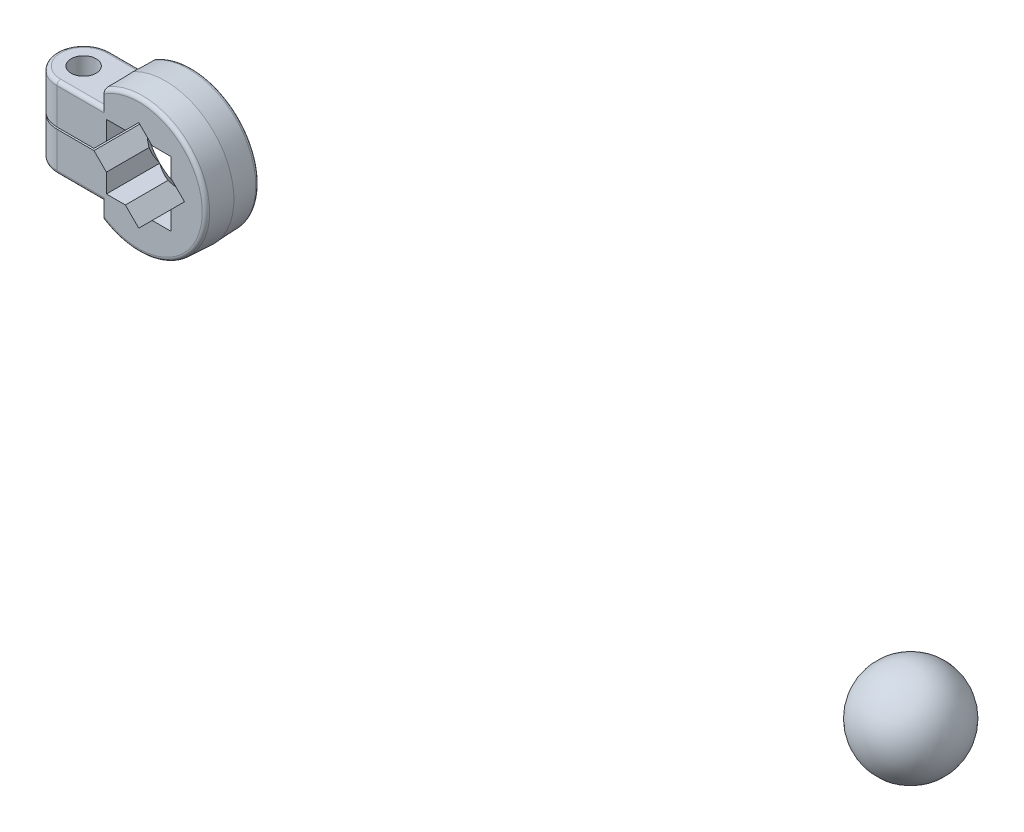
ISO-10303-21;
HEADER;
FILE_DESCRIPTION(('STEP AP214'),'2;1');
FILE_NAME('part.step','',(''),(''),'','','');
FILE_SCHEMA(('AUTOMOTIVE_DESIGN { 1 0 10303 214 1 1 1 1 }'));
ENDSEC;
DATA;
#1=APPLICATION_CONTEXT('core data for automotive mechanical design processes');
#2=APPLICATION_PROTOCOL_DEFINITION('international standard','automotive_design',2000,#1);
#3=PRODUCT_CONTEXT('',#1,'mechanical');
#4=PRODUCT('Part','Part','',(#3));
#5=PRODUCT_RELATED_PRODUCT_CATEGORY('part','',(#4));
#6=PRODUCT_DEFINITION_FORMATION('','',#4);
#7=PRODUCT_DEFINITION_CONTEXT('part definition',#1,'design');
#8=PRODUCT_DEFINITION('design','',#6,#7);
#9=PRODUCT_DEFINITION_SHAPE('','',#8);
#10=(LENGTH_UNIT() NAMED_UNIT(*) SI_UNIT(.MILLI.,.METRE.));
#11=(NAMED_UNIT(*) PLANE_ANGLE_UNIT() SI_UNIT($,.RADIAN.));
#12=(NAMED_UNIT(*) SI_UNIT($,.STERADIAN.) SOLID_ANGLE_UNIT());
#13=UNCERTAINTY_MEASURE_WITH_UNIT(LENGTH_MEASURE(1.E-05),#10,'distance_accuracy_value','');
#14=(GEOMETRIC_REPRESENTATION_CONTEXT(3) GLOBAL_UNCERTAINTY_ASSIGNED_CONTEXT((#13)) GLOBAL_UNIT_ASSIGNED_CONTEXT((#10,
#11,#12)) REPRESENTATION_CONTEXT('',''));
#15=CARTESIAN_POINT('',(0.,0.,0.));
#16=DIRECTION('',(0.,0.,1.));
#17=DIRECTION('',(1.,0.,0.));
#18=AXIS2_PLACEMENT_3D('',#15,#16,#17);
#19=CARTESIAN_POINT('',(225.,0.,29.2));
#20=DIRECTION('',(0.,1.,0.));
#21=DIRECTION('',(0.,0.,-1.));
#22=AXIS2_PLACEMENT_3D('',#19,#20,#21);
#23=SPHERICAL_SURFACE('',#22,12.5);
#24=CARTESIAN_POINT('',(225.,12.5,29.2));
#25=VERTEX_POINT('',#24);
#26=VERTEX_LOOP('',#25);
#27=FACE_BOUND('',#26,.T.);
#28=ADVANCED_FACE('F38',(#27),#23,.T.);
#29=CLOSED_SHELL('',(#28));
#30=MANIFOLD_SOLID_BREP('B2',#29);
#31=CARTESIAN_POINT('',(-21.4903935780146,10.6331455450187,0.));
#32=DIRECTION('',(0.,-1.,0.));
#33=DIRECTION('',(0.,0.,-1.));
#34=AXIS2_PLACEMENT_3D('',#31,#32,#33);
#35=CYLINDRICAL_SURFACE('',#34,7.);
#36=CARTESIAN_POINT('',(-21.4903935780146,-0.250000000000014,0.));
#37=DIRECTION('',(0.,-1.,0.));
#38=DIRECTION('',(1.,0.,0.));
#39=AXIS2_PLACEMENT_3D('',#36,#37,#38);
#40=CIRCLE('',#39,7.);
#41=CARTESIAN_POINT('',(-21.4903935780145,-0.250000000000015,-7.));
#42=VERTEX_POINT('',#41);
#43=CARTESIAN_POINT('',(-21.4903935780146,-0.250000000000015,7.));
#44=VERTEX_POINT('',#43);
#45=EDGE_CURVE('E1209',#42,#44,#40,.F.);
#46=ORIENTED_EDGE('',*,*,#45,.F.);
#47=DIRECTION('',(0.,1.,0.));
#48=VECTOR('',#47,1.);
#49=CARTESIAN_POINT('',(-21.4903935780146,10.6331455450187,-7.));
#50=LINE('',#49,#48);
#51=CARTESIAN_POINT('',(-21.4903935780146,-9.63314554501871,-7.));
#52=VERTEX_POINT('',#51);
#53=EDGE_CURVE('E702',#52,#42,#50,.T.);
#54=ORIENTED_EDGE('',*,*,#53,.F.);
#55=CARTESIAN_POINT('',(-21.4903935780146,-9.63314554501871,0.));
#56=DIRECTION('',(0.,-1.,0.));
#57=DIRECTION('',(1.,0.,0.));
#58=AXIS2_PLACEMENT_3D('',#55,#56,#57);
#59=CIRCLE('',#58,7.);
#60=CARTESIAN_POINT('',(-21.4903935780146,-9.63314554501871,7.));
#61=VERTEX_POINT('',#60);
#62=EDGE_CURVE('E716',#52,#61,#59,.F.);
#63=ORIENTED_EDGE('',*,*,#62,.T.);
#64=DIRECTION('',(0.,-1.,0.));
#65=VECTOR('',#64,1.);
#66=CARTESIAN_POINT('',(-21.4903935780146,0.,7.));
#67=LINE('',#66,#65);
#68=EDGE_CURVE('E388',#44,#61,#67,.T.);
#69=ORIENTED_EDGE('',*,*,#68,.F.);
#70=EDGE_LOOP('',(#46,#54,#63,#69));
#71=FACE_BOUND('',#70,.T.);
#72=ADVANCED_FACE('F50',(#71),#35,.T.);
#73=CARTESIAN_POINT('',(-21.4903935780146,18.001,0.));
#74=DIRECTION('',(0.,-1.,0.));
#75=DIRECTION('',(0.,0.,-1.));
#76=AXIS2_PLACEMENT_3D('',#73,#74,#75);
#77=CYLINDRICAL_SURFACE('',#76,3.3);
#78=CARTESIAN_POINT('',(-21.4903935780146,-0.250000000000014,0.));
#79=DIRECTION('',(0.,-1.,0.));
#80=DIRECTION('',(1.,0.,0.));
#81=AXIS2_PLACEMENT_3D('',#78,#79,#80);
#82=CIRCLE('',#81,3.3);
#83=CARTESIAN_POINT('',(-18.1903935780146,-0.250000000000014,0.));
#84=VERTEX_POINT('',#83);
#85=EDGE_CURVE('E673',#84,#84,#82,.T.);
#86=ORIENTED_EDGE('',*,*,#85,.F.);
#87=EDGE_LOOP('',(#86));
#88=FACE_BOUND('',#87,.T.);
#89=CARTESIAN_POINT('',(-21.4903935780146,-10.6331455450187,0.));
#90=DIRECTION('',(0.,-1.,0.));
#91=DIRECTION('',(1.,0.,0.));
#92=AXIS2_PLACEMENT_3D('',#89,#90,#91);
#93=CIRCLE('',#92,3.3);
#94=CARTESIAN_POINT('',(-18.1903935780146,-10.6331455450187,0.));
#95=VERTEX_POINT('',#94);
#96=EDGE_CURVE('E691',#95,#95,#93,.T.);
#97=ORIENTED_EDGE('',*,*,#96,.T.);
#98=EDGE_LOOP('',(#97));
#99=FACE_BOUND('',#98,.T.);
#100=ADVANCED_FACE('F647',(#88,#99),#77,.F.);
#101=CARTESIAN_POINT('',(-21.4903935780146,0.249999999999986,0.));
#102=DIRECTION('',(0.,1.,0.));
#103=DIRECTION('',(0.,0.,1.));
#104=AXIS2_PLACEMENT_3D('',#101,#102,#103);
#105=CIRCLE('',#104,7.);
#106=CARTESIAN_POINT('',(-21.4903935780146,0.249999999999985,7.));
#107=VERTEX_POINT('',#106);
#108=CARTESIAN_POINT('',(-21.4903935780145,0.249999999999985,-7.));
#109=VERTEX_POINT('',#108);
#110=EDGE_CURVE('E664',#107,#109,#105,.F.);
#111=ORIENTED_EDGE('',*,*,#110,.F.);
#112=CARTESIAN_POINT('',(-21.4903935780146,9.63314554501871,7.));
#113=VERTEX_POINT('',#112);
#114=EDGE_CURVE('E288',#113,#107,#67,.T.);
#115=ORIENTED_EDGE('',*,*,#114,.F.);
#116=CARTESIAN_POINT('',(-21.4903935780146,9.63314554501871,0.));
#117=DIRECTION('',(0.,1.,0.));
#118=DIRECTION('',(-1.,0.,0.));
#119=AXIS2_PLACEMENT_3D('',#116,#117,#118);
#120=CIRCLE('',#119,7.);
#121=CARTESIAN_POINT('',(-21.4903935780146,9.63314554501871,-7.));
#122=VERTEX_POINT('',#121);
#123=EDGE_CURVE('E714',#113,#122,#120,.F.);
#124=ORIENTED_EDGE('',*,*,#123,.T.);
#125=EDGE_CURVE('E667',#109,#122,#50,.T.);
#126=ORIENTED_EDGE('',*,*,#125,.F.);
#127=EDGE_LOOP('',(#111,#115,#124,#126));
#128=FACE_BOUND('',#127,.T.);
#129=ADVANCED_FACE('F650',(#128),#35,.T.);
#130=CARTESIAN_POINT('',(-21.4903935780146,0.249999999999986,0.));
#131=DIRECTION('',(0.,1.,0.));
#132=DIRECTION('',(0.,0.,1.));
#133=AXIS2_PLACEMENT_3D('',#130,#131,#132);
#134=CIRCLE('',#133,3.3);
#135=CARTESIAN_POINT('',(-21.4903935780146,0.249999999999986,3.3));
#136=VERTEX_POINT('',#135);
#137=EDGE_CURVE('E668',#136,#136,#134,.T.);
#138=ORIENTED_EDGE('',*,*,#137,.F.);
#139=EDGE_LOOP('',(#138));
#140=FACE_BOUND('',#139,.T.);
#141=CARTESIAN_POINT('',(-21.4903935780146,10.6331455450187,0.));
#142=DIRECTION('',(0.,1.,0.));
#143=DIRECTION('',(-1.,0.,0.));
#144=AXIS2_PLACEMENT_3D('',#141,#142,#143);
#145=CIRCLE('',#144,3.3);
#146=CARTESIAN_POINT('',(-24.7903935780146,10.6331455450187,0.));
#147=VERTEX_POINT('',#146);
#148=EDGE_CURVE('E679',#147,#147,#145,.T.);
#149=ORIENTED_EDGE('',*,*,#148,.T.);
#150=EDGE_LOOP('',(#149));
#151=FACE_BOUND('',#150,.T.);
#152=ADVANCED_FACE('F400',(#140,#151),#77,.F.);
#153=CARTESIAN_POINT('',(0.,0.,0.));
#154=DIRECTION('',(0.,0.,1.));
#155=DIRECTION('',(1.,0.,0.));
#156=AXIS2_PLACEMENT_3D('',#153,#154,#155);
#157=CONICAL_SURFACE('',#156,18.,0.0523598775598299);
#158=CARTESIAN_POINT('',(-8.42600194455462,-15.9060638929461,0.000200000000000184));
#159=CARTESIAN_POINT('',(-8.42599956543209,-15.8885157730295,-0.295614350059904));
#160=CARTESIAN_POINT('',(-8.42974911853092,-15.8689933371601,-0.591296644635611));
#161=CARTESIAN_POINT('',(-8.44472425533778,-15.8259402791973,-1.18218105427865));
#162=CARTESIAN_POINT('',(-8.45594987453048,-15.8024096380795,-1.47738316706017));
#163=CARTESIAN_POINT('',(-8.50069521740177,-15.725893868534,-2.3598934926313));
#164=CARTESIAN_POINT('',(-8.54528397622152,-15.6668637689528,-2.94616280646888));
#165=CARTESIAN_POINT('',(-8.66365076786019,-15.5316894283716,-4.11378905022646));
#166=CARTESIAN_POINT('',(-8.7374295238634,-15.455544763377,-4.69514585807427));
#167=CARTESIAN_POINT('',(-8.86964714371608,-15.3271884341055,-5.56276612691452));
#168=CARTESIAN_POINT('',(-8.91741268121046,-15.2819558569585,-5.85173318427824));
#169=CARTESIAN_POINT('',(-9.02001958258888,-15.1865252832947,-6.42759162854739));
#170=CARTESIAN_POINT('',(-9.07486114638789,-15.1363271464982,-6.71448295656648));
#171=CARTESIAN_POINT('',(-9.13318637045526,-15.0835128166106,-7.00020000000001));
#172=B_SPLINE_CURVE_WITH_KNOTS('',3,(#158,#159,#160,#161,#162,#163,#164,#165,#166,#167,#168,
#169,#170,#171),.UNSPECIFIED.,.F.,.F.,(4,2,2,2,2,2,4),(0.,0.888942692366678,1.77788960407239,
3.54961068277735,5.3213756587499,6.2103396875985,7.09932883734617),.UNSPECIFIED.);
#173=CARTESIAN_POINT('',(-8.42600194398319,-15.9060520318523,0.));
#174=VERTEX_POINT('',#173);
#175=CARTESIAN_POINT('',(-8.95327026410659,-15.2486307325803,-6.05233595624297));
#176=VERTEX_POINT('',#175);
#177=EDGE_CURVE('E613',#174,#176,#172,.T.);
#178=ORIENTED_EDGE('',*,*,#177,.T.);
#179=CARTESIAN_POINT('',(0.,0.,-6.05233595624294));
#180=DIRECTION('',(0.,0.,1.));
#181=DIRECTION('',(1.,0.,0.));
#182=AXIS2_PLACEMENT_3D('',#179,#180,#181);
#183=CIRCLE('',#182,17.6828105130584);
#184=CARTESIAN_POINT('',(-8.95327026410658,15.2486307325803,-6.05233595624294));
#185=VERTEX_POINT('',#184);
#186=EDGE_CURVE('E571',#176,#185,#183,.T.);
#187=ORIENTED_EDGE('',*,*,#186,.T.);
#188=CARTESIAN_POINT('',(-8.42600194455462,15.9060638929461,0.000200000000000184));
#189=CARTESIAN_POINT('',(-8.42599956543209,15.8885157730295,-0.295614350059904));
#190=CARTESIAN_POINT('',(-8.42974911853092,15.8689933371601,-0.591296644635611));
#191=CARTESIAN_POINT('',(-8.44472425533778,15.8259402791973,-1.18218105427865));
#192=CARTESIAN_POINT('',(-8.45594987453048,15.8024096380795,-1.47738316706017));
#193=CARTESIAN_POINT('',(-8.50069521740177,15.725893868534,-2.3598934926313));
#194=CARTESIAN_POINT('',(-8.54528397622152,15.6668637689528,-2.94616280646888));
#195=CARTESIAN_POINT('',(-8.66365076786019,15.5316894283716,-4.11378905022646));
#196=CARTESIAN_POINT('',(-8.7374295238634,15.455544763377,-4.69514585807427));
#197=CARTESIAN_POINT('',(-8.86964714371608,15.3271884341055,-5.56276612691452));
#198=CARTESIAN_POINT('',(-8.91741268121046,15.2819558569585,-5.85173318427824));
#199=CARTESIAN_POINT('',(-9.02001958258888,15.1865252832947,-6.42759162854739));
#200=CARTESIAN_POINT('',(-9.07486114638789,15.1363271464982,-6.71448295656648));
#201=CARTESIAN_POINT('',(-9.13318637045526,15.0835128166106,-7.00020000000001));
#202=B_SPLINE_CURVE_WITH_KNOTS('',3,(#188,#189,#190,#191,#192,#193,#194,#195,#196,#197,#198,
#199,#200,#201),.UNSPECIFIED.,.F.,.F.,(4,2,2,2,2,2,4),(0.,0.888942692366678,1.77788960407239,
3.54961068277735,5.3213756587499,6.2103396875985,7.09932883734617),.UNSPECIFIED.);
#203=CARTESIAN_POINT('',(-8.42600194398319,15.9060520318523,0.));
#204=VERTEX_POINT('',#203);
#205=EDGE_CURVE('E542',#204,#185,#202,.T.);
#206=ORIENTED_EDGE('',*,*,#205,.F.);
#207=CARTESIAN_POINT('',(0.,0.,0.));
#208=DIRECTION('',(0.,0.,1.));
#209=DIRECTION('',(1.,0.,0.));
#210=AXIS2_PLACEMENT_3D('',#207,#208,#209);
#211=CIRCLE('',#210,18.);
#212=EDGE_CURVE('E374',#174,#204,#211,.T.);
#213=ORIENTED_EDGE('',*,*,#212,.F.);
#214=EDGE_LOOP('',(#178,#187,#206,#213));
#215=FACE_BOUND('',#214,.T.);
#216=ADVANCED_FACE('F661',(#215),#157,.T.);
#217=CARTESIAN_POINT('',(0.,0.,0.));
#218=DIRECTION('',(0.,0.,-1.));
#219=DIRECTION('',(1.,0.,0.));
#220=AXIS2_PLACEMENT_3D('',#217,#218,#219);
#221=CONICAL_SURFACE('',#220,18.,0.0523598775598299);
#222=CARTESIAN_POINT('',(-8.42600194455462,15.9060638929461,-0.000200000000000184));
#223=CARTESIAN_POINT('',(-8.42599956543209,15.8885157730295,0.295614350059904));
#224=CARTESIAN_POINT('',(-8.42974911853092,15.8689933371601,0.591296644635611));
#225=CARTESIAN_POINT('',(-8.44472425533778,15.8259402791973,1.18218105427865));
#226=CARTESIAN_POINT('',(-8.45594987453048,15.8024096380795,1.47738316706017));
#227=CARTESIAN_POINT('',(-8.50069521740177,15.725893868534,2.3598934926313));
#228=CARTESIAN_POINT('',(-8.54528397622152,15.6668637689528,2.94616280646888));
#229=CARTESIAN_POINT('',(-8.66365076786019,15.5316894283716,4.11378905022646));
#230=CARTESIAN_POINT('',(-8.7374295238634,15.455544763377,4.69514585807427));
#231=CARTESIAN_POINT('',(-8.86964714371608,15.3271884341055,5.56276612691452));
#232=CARTESIAN_POINT('',(-8.91741268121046,15.2819558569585,5.85173318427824));
#233=CARTESIAN_POINT('',(-9.02001958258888,15.1865252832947,6.42759162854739));
#234=CARTESIAN_POINT('',(-9.07486114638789,15.1363271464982,6.71448295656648));
#235=CARTESIAN_POINT('',(-9.13318637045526,15.0835128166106,7.00020000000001));
#236=B_SPLINE_CURVE_WITH_KNOTS('',3,(#222,#223,#224,#225,#226,#227,#228,#229,#230,#231,#232,
#233,#234,#235),.UNSPECIFIED.,.F.,.F.,(4,2,2,2,2,2,4),(0.,0.888942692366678,1.77788960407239,
3.54961068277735,5.3213756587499,6.2103396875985,7.09932883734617),.UNSPECIFIED.);
#237=CARTESIAN_POINT('',(-8.95327026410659,15.2486307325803,6.05233595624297));
#238=VERTEX_POINT('',#237);
#239=EDGE_CURVE('E532',#204,#238,#236,.T.);
#240=ORIENTED_EDGE('',*,*,#239,.T.);
#241=CARTESIAN_POINT('',(0.,0.,6.05233595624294));
#242=DIRECTION('',(0.,0.,-1.));
#243=DIRECTION('',(-1.,0.,0.));
#244=AXIS2_PLACEMENT_3D('',#241,#242,#243);
#245=CIRCLE('',#244,17.6828105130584);
#246=CARTESIAN_POINT('',(-8.95327026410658,-15.2486307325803,6.05233595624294));
#247=VERTEX_POINT('',#246);
#248=EDGE_CURVE('E508',#238,#247,#245,.T.);
#249=ORIENTED_EDGE('',*,*,#248,.T.);
#250=CARTESIAN_POINT('',(-8.42600194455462,-15.9060638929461,-0.000200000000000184));
#251=CARTESIAN_POINT('',(-8.42599956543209,-15.8885157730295,0.295614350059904));
#252=CARTESIAN_POINT('',(-8.42974911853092,-15.8689933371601,0.591296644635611));
#253=CARTESIAN_POINT('',(-8.44472425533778,-15.8259402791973,1.18218105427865));
#254=CARTESIAN_POINT('',(-8.45594987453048,-15.8024096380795,1.47738316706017));
#255=CARTESIAN_POINT('',(-8.50069521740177,-15.725893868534,2.3598934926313));
#256=CARTESIAN_POINT('',(-8.54528397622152,-15.6668637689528,2.94616280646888));
#257=CARTESIAN_POINT('',(-8.66365076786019,-15.5316894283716,4.11378905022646));
#258=CARTESIAN_POINT('',(-8.7374295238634,-15.455544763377,4.69514585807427));
#259=CARTESIAN_POINT('',(-8.86964714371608,-15.3271884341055,5.56276612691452));
#260=CARTESIAN_POINT('',(-8.91741268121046,-15.2819558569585,5.85173318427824));
#261=CARTESIAN_POINT('',(-9.02001958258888,-15.1865252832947,6.42759162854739));
#262=CARTESIAN_POINT('',(-9.07486114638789,-15.1363271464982,6.71448295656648));
#263=CARTESIAN_POINT('',(-9.13318637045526,-15.0835128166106,7.00020000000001));
#264=B_SPLINE_CURVE_WITH_KNOTS('',3,(#250,#251,#252,#253,#254,#255,#256,#257,#258,#259,#260,
#261,#262,#263),.UNSPECIFIED.,.F.,.F.,(4,2,2,2,2,2,4),(0.,0.888942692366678,1.77788960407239,
3.54961068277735,5.3213756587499,6.2103396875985,7.09932883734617),.UNSPECIFIED.);
#265=EDGE_CURVE('E606',#174,#247,#264,.T.);
#266=ORIENTED_EDGE('',*,*,#265,.F.);
#267=ORIENTED_EDGE('',*,*,#212,.T.);
#268=EDGE_LOOP('',(#240,#249,#266,#267));
#269=FACE_BOUND('',#268,.T.);
#270=ADVANCED_FACE('F779',(#269),#221,.T.);
#271=CARTESIAN_POINT('',(-8.5,-8.5,7.001));
#272=DIRECTION('',(1.,0.,0.));
#273=DIRECTION('',(0.,0.,-1.));
#274=AXIS2_PLACEMENT_3D('',#271,#272,#273);
#275=PLANE('',#274);
#276=DIRECTION('',(0.,0.,-1.));
#277=VECTOR('',#276,1.);
#278=CARTESIAN_POINT('',(-8.5,-8.5,7.001));
#279=LINE('',#278,#277);
#280=CARTESIAN_POINT('',(-8.5,-8.5,7.));
#281=VERTEX_POINT('',#280);
#282=CARTESIAN_POINT('',(-8.5,-8.5,-7.));
#283=VERTEX_POINT('',#282);
#284=EDGE_CURVE('E362',#281,#283,#279,.T.);
#285=ORIENTED_EDGE('',*,*,#284,.T.);
#286=CARTESIAN_POINT('',(-8.5,-16.6036305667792,-13.632081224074));
#287=CARTESIAN_POINT('',(-8.5,-16.2608714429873,-13.3270115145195));
#288=CARTESIAN_POINT('',(-8.5,-15.9171656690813,-13.0229978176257));
#289=CARTESIAN_POINT('',(-8.5,-15.2274389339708,-12.4175699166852));
#290=CARTESIAN_POINT('',(-8.5,-14.8814178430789,-12.116155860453));
#291=CARTESIAN_POINT('',(-8.5,-14.1859330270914,-11.5158068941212));
#292=CARTESIAN_POINT('',(-8.5,-13.8364635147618,-11.2168786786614));
#293=CARTESIAN_POINT('',(-8.5,-13.1342891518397,-10.6228567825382));
#294=CARTESIAN_POINT('',(-8.5,-12.7815843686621,-10.3277630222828));
#295=CARTESIAN_POINT('',(-8.5,-12.047522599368,-9.72187344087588));
#296=CARTESIAN_POINT('',(-8.5,-11.6658835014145,-9.41141860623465));
#297=CARTESIAN_POINT('',(-8.5,-10.8971003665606,-8.79740642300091));
#298=CARTESIAN_POINT('',(-8.5,-10.509956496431,-8.49384886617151));
#299=CARTESIAN_POINT('',(-8.5,-9.72911869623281,-7.89594438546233));
#300=CARTESIAN_POINT('',(-8.5,-9.33543068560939,-7.60158976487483));
#301=CARTESIAN_POINT('',(-8.5,-8.53945808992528,-7.02480855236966));
#302=CARTESIAN_POINT('',(-8.5,-8.13717474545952,-6.74238025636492));
#303=CARTESIAN_POINT('',(-8.5,-7.34032329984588,-6.20626473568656));
#304=CARTESIAN_POINT('',(-8.5,-6.9462479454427,-5.95185338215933));
#305=CARTESIAN_POINT('',(-8.5,-6.34569332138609,-5.58544723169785));
#306=CARTESIAN_POINT('',(-8.5,-6.14387319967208,-5.4658135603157));
#307=CARTESIAN_POINT('',(-8.5,-5.73675773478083,-5.23259906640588));
#308=CARTESIAN_POINT('',(-8.5,-5.5314624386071,-5.1190181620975));
#309=CARTESIAN_POINT('',(-8.5,-5.12157965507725,-4.90143716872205));
#310=CARTESIAN_POINT('',(-8.5,-4.91707531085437,-4.79728163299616));
#311=CARTESIAN_POINT('',(-8.5,-4.50413470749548,-4.59711616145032));
#312=CARTESIAN_POINT('',(-8.5,-4.29569820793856,-4.50110672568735));
#313=CARTESIAN_POINT('',(-8.5,-3.66441665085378,-4.22765333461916));
#314=CARTESIAN_POINT('',(-8.5,-3.23506066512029,-4.06448984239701));
#315=CARTESIAN_POINT('',(-8.5,-2.54733502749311,-3.84950071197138));
#316=CARTESIAN_POINT('',(-8.5,-2.29447672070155,-3.77991752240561));
#317=CARTESIAN_POINT('',(-8.5,-1.78408091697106,-3.66086113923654));
#318=CARTESIAN_POINT('',(-8.5,-1.52654596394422,-3.61137733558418));
#319=CARTESIAN_POINT('',(-8.5,-1.13501572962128,-3.55362721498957));
#320=CARTESIAN_POINT('',(-8.5,-1.00220861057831,-3.53703911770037));
#321=CARTESIAN_POINT('',(-8.5,-0.735965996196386,-3.5099596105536));
#322=CARTESIAN_POINT('',(-8.5,-0.602530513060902,-3.4994680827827));
#323=CARTESIAN_POINT('',(-8.5,-0.335033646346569,-3.48473544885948));
#324=CARTESIAN_POINT('',(-8.5,-0.200971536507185,-3.48050754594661));
#325=CARTESIAN_POINT('',(-8.5,0.0672192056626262,-3.47838805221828));
#326=CARTESIAN_POINT('',(-8.5,0.201347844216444,-3.48049725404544));
#327=CARTESIAN_POINT('',(-8.5,0.335353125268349,-3.48579754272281));
#328=B_SPLINE_CURVE_WITH_KNOTS('',3,(#286,#287,#288,#289,#290,#291,#292,#293,#294,#295,#296,
#297,#298,#299,#300,#301,#302,#303,#304,#305,#306,#307,#308,#309,#310,#311,#312,#313,#314,#315,
#316,#317,#318,#319,#320,#321,#322,#323,#324,#325,#326,#327),.UNSPECIFIED.,.F.,.F.,(4,2,2,2,2,2,
2,2,2,2,2,2,2,2,2,2,2,2,2,2,4),(0.,1.37658153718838,2.75324083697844,4.13284944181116,
5.51242936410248,6.98826508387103,8.46405618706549,9.93857809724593,11.4128886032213,
12.8195614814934,13.5233181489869,14.2270653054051,14.9153849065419,15.6037467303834,
16.9786332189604,17.764772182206,18.5504956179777,18.9518959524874,19.3532885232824,
19.7555260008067,20.1578137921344),.UNSPECIFIED.);
#329=CARTESIAN_POINT('',(-8.5,-3.52081528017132,-4.17951842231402));
#330=VERTEX_POINT('',#329);
#331=EDGE_CURVE('E423',#283,#330,#328,.T.);
#332=ORIENTED_EDGE('',*,*,#331,.T.);
#333=DIRECTION('',(0.,0.,1.));
#334=VECTOR('',#333,1.);
#335=CARTESIAN_POINT('',(-8.5,-3.52081528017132,-7.001));
#336=LINE('',#335,#334);
#337=CARTESIAN_POINT('',(-8.5,-3.52081528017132,7.));
#338=VERTEX_POINT('',#337);
#339=EDGE_CURVE('E296',#330,#338,#336,.T.);
#340=ORIENTED_EDGE('',*,*,#339,.T.);
#341=DIRECTION('',(0.,-1.,0.));
#342=VECTOR('',#341,1.);
#343=CARTESIAN_POINT('',(-8.5,-8.5,7.));
#344=LINE('',#343,#342);
#345=EDGE_CURVE('E351',#338,#281,#344,.T.);
#346=ORIENTED_EDGE('',*,*,#345,.T.);
#347=EDGE_LOOP('',(#285,#332,#340,#346));
#348=FACE_BOUND('',#347,.T.);
#349=ADVANCED_FACE('F837',(#348),#275,.T.);
#350=CARTESIAN_POINT('',(8.5,8.5,7.001));
#351=DIRECTION('',(0.,-1.,0.));
#352=DIRECTION('',(0.,0.,-1.));
#353=AXIS2_PLACEMENT_3D('',#350,#351,#352);
#354=PLANE('',#353);
#355=DIRECTION('',(0.,0.,-1.));
#356=VECTOR('',#355,1.);
#357=CARTESIAN_POINT('',(3.5208152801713,8.5,-7.001));
#358=LINE('',#357,#356);
#359=CARTESIAN_POINT('',(3.5208152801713,8.5,7.));
#360=VERTEX_POINT('',#359);
#361=CARTESIAN_POINT('',(3.5208152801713,8.5,-4.17951842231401));
#362=VERTEX_POINT('',#361);
#363=EDGE_CURVE('E312',#360,#362,#358,.T.);
#364=ORIENTED_EDGE('',*,*,#363,.T.);
#365=CARTESIAN_POINT('',(0.439266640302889,8.5,-3.49052745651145));
#366=CARTESIAN_POINT('',(0.57547724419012,8.5,-3.49754128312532));
#367=CARTESIAN_POINT('',(0.711507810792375,8.5,-3.50783839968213));
#368=CARTESIAN_POINT('',(0.982909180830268,8.5,-3.5347649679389));
#369=CARTESIAN_POINT('',(1.11828013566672,8.5,-3.55139288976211));
#370=CARTESIAN_POINT('',(1.38789120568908,8.5,-3.5907158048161));
#371=CARTESIAN_POINT('',(1.52213289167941,8.5,-3.61340006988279));
#372=CARTESIAN_POINT('',(1.78951299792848,8.5,-3.66452474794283));
#373=CARTESIAN_POINT('',(1.92265136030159,8.5,-3.69296546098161));
#374=CARTESIAN_POINT('',(2.31723423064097,8.5,-3.78570130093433));
#375=CARTESIAN_POINT('',(2.57685438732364,8.5,-3.85786448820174));
#376=CARTESIAN_POINT('',(3.0903318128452,8.5,-4.02024265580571));
#377=CARTESIAN_POINT('',(3.34418831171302,8.5,-4.11046003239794));
#378=CARTESIAN_POINT('',(3.70674660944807,8.5,-4.25169238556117));
#379=CARTESIAN_POINT('',(3.81783881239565,8.5,-4.29668605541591));
#380=CARTESIAN_POINT('',(3.98370542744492,8.5,-4.36627070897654));
#381=CARTESIAN_POINT('',(4.03891039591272,8.5,-4.38983469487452));
#382=CARTESIAN_POINT('',(4.14903136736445,8.5,-4.43762031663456));
#383=CARTESIAN_POINT('',(4.20394738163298,8.5,-4.46184192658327));
#384=CARTESIAN_POINT('',(4.60544091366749,8.5,-4.64168512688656));
#385=CARTESIAN_POINT('',(4.94657157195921,8.5,-4.80960286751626));
#386=CARTESIAN_POINT('',(5.61885074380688,8.5,-5.16446412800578));
#387=CARTESIAN_POINT('',(5.94999311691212,8.5,-5.3514190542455));
#388=CARTESIAN_POINT('',(6.60469390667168,8.5,-5.7403402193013));
#389=CARTESIAN_POINT('',(6.92822542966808,8.5,-5.94235148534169));
#390=CARTESIAN_POINT('',(7.56795959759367,8.5,-6.357445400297));
#391=CARTESIAN_POINT('',(7.88416377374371,8.5,-6.57052570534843));
#392=CARTESIAN_POINT('',(8.50459728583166,8.5,-7.00121853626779));
#393=CARTESIAN_POINT('',(8.80893999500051,8.5,-7.21866842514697));
#394=CARTESIAN_POINT('',(9.41279613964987,8.5,-7.66020798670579));
#395=CARTESIAN_POINT('',(9.71230915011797,8.5,-7.88429823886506));
#396=CARTESIAN_POINT('',(10.3050004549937,8.5,-8.33607194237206));
#397=CARTESIAN_POINT('',(10.5982096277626,8.5,-8.56371500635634));
#398=CARTESIAN_POINT('',(11.1811515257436,8.5,-9.023273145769));
#399=CARTESIAN_POINT('',(11.4708850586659,8.5,-9.25518719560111));
#400=CARTESIAN_POINT('',(11.759215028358,8.5,-9.48880697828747));
#401=B_SPLINE_CURVE_WITH_KNOTS('',3,(#365,#366,#367,#368,#369,#370,#371,#372,#373,#374,#375,
#376,#377,#378,#379,#380,#381,#382,#383,#384,#385,#386,#387,#388,#389,#390,#391,#392,#393,#394,
#395,#396,#397,#398,#399,#400),.UNSPECIFIED.,.F.,.F.,(4,2,2,2,2,2,2,2,2,2,2,2,2,2,2,2,2,4),(0.,
0.40911744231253,0.818136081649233,1.22643494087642,1.63475508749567,2.4422980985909,
3.24994836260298,3.6094928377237,3.78955905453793,3.96961818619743,5.10933064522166,
6.24973004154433,7.39368845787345,8.53740562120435,9.65942814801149,10.7815488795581,
11.895119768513,13.0084266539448),.UNSPECIFIED.);
#402=CARTESIAN_POINT('',(8.5,8.5,-7.));
#403=VERTEX_POINT('',#402);
#404=EDGE_CURVE('E483',#362,#403,#401,.T.);
#405=ORIENTED_EDGE('',*,*,#404,.T.);
#406=DIRECTION('',(0.,0.,-1.));
#407=VECTOR('',#406,1.);
#408=CARTESIAN_POINT('',(8.5,8.5,7.001));
#409=LINE('',#408,#407);
#410=CARTESIAN_POINT('',(8.5,8.5,7.));
#411=VERTEX_POINT('',#410);
#412=EDGE_CURVE('E357',#411,#403,#409,.T.);
#413=ORIENTED_EDGE('',*,*,#412,.F.);
#414=DIRECTION('',(-1.,0.,0.));
#415=VECTOR('',#414,1.);
#416=CARTESIAN_POINT('',(8.5,8.5,7.));
#417=LINE('',#416,#415);
#418=EDGE_CURVE('E366',#411,#360,#417,.T.);
#419=ORIENTED_EDGE('',*,*,#418,.T.);
#420=EDGE_LOOP('',(#364,#405,#413,#419));
#421=FACE_BOUND('',#420,.T.);
#422=ADVANCED_FACE('F871',(#421),#354,.T.);
#423=CARTESIAN_POINT('',(8.5,-8.5,7.001));
#424=DIRECTION('',(-1.,0.,0.));
#425=DIRECTION('',(0.,0.,1.));
#426=AXIS2_PLACEMENT_3D('',#423,#424,#425);
#427=PLANE('',#426);
#428=DIRECTION('',(0.,0.,-1.));
#429=VECTOR('',#428,1.);
#430=CARTESIAN_POINT('',(8.5,-3.5208152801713,-7.001));
#431=LINE('',#430,#429);
#432=CARTESIAN_POINT('',(8.5,-3.5208152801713,7.));
#433=VERTEX_POINT('',#432);
#434=CARTESIAN_POINT('',(8.5,-3.5208152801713,-4.17951842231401));
#435=VERTEX_POINT('',#434);
#436=EDGE_CURVE('E325',#433,#435,#431,.T.);
#437=ORIENTED_EDGE('',*,*,#436,.T.);
#438=CARTESIAN_POINT('',(8.5,-16.6036305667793,-13.6320812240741));
#439=CARTESIAN_POINT('',(8.5,-16.2608714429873,-13.3270115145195));
#440=CARTESIAN_POINT('',(8.5,-15.9171656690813,-13.0229978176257));
#441=CARTESIAN_POINT('',(8.5,-15.2274389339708,-12.4175699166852));
#442=CARTESIAN_POINT('',(8.5,-14.8814178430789,-12.116155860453));
#443=CARTESIAN_POINT('',(8.5,-14.1859330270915,-11.5158068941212));
#444=CARTESIAN_POINT('',(8.5,-13.8364635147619,-11.2168786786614));
#445=CARTESIAN_POINT('',(8.5,-13.1342891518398,-10.6228567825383));
#446=CARTESIAN_POINT('',(8.5,-12.7815843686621,-10.3277630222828));
#447=CARTESIAN_POINT('',(8.5,-12.047522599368,-9.72187344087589));
#448=CARTESIAN_POINT('',(8.5,-11.6658835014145,-9.41141860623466));
#449=CARTESIAN_POINT('',(8.5,-10.8971003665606,-8.79740642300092));
#450=CARTESIAN_POINT('',(8.5,-10.509956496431,-8.49384886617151));
#451=CARTESIAN_POINT('',(8.5,-9.72911869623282,-7.89594438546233));
#452=CARTESIAN_POINT('',(8.5,-9.33543068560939,-7.60158976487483));
#453=CARTESIAN_POINT('',(8.5,-8.53945808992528,-7.02480855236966));
#454=CARTESIAN_POINT('',(8.5,-8.13717474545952,-6.74238025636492));
#455=CARTESIAN_POINT('',(8.5,-7.34032329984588,-6.20626473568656));
#456=CARTESIAN_POINT('',(8.5,-6.94624794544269,-5.95185338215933));
#457=CARTESIAN_POINT('',(8.5,-6.34569332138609,-5.58544723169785));
#458=CARTESIAN_POINT('',(8.5,-6.14387319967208,-5.4658135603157));
#459=CARTESIAN_POINT('',(8.5,-5.73675773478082,-5.23259906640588));
#460=CARTESIAN_POINT('',(8.5,-5.53146243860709,-5.1190181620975));
#461=CARTESIAN_POINT('',(8.5,-5.12157965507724,-4.90143716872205));
#462=CARTESIAN_POINT('',(8.5,-4.91707531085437,-4.79728163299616));
#463=CARTESIAN_POINT('',(8.5,-4.50413470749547,-4.59711616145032));
#464=CARTESIAN_POINT('',(8.5,-4.29569820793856,-4.50110672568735));
#465=CARTESIAN_POINT('',(8.5,-3.66441665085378,-4.22765333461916));
#466=CARTESIAN_POINT('',(8.5,-3.23506066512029,-4.06448984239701));
#467=CARTESIAN_POINT('',(8.5,-2.5473350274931,-3.84950071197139));
#468=CARTESIAN_POINT('',(8.5,-2.29447672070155,-3.77991752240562));
#469=CARTESIAN_POINT('',(8.5,-1.78408091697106,-3.66086113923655));
#470=CARTESIAN_POINT('',(8.5,-1.52654596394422,-3.61137733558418));
#471=CARTESIAN_POINT('',(8.5,-1.13501572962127,-3.55362721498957));
#472=CARTESIAN_POINT('',(8.5,-1.00220861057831,-3.53703911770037));
#473=CARTESIAN_POINT('',(8.5,-0.735965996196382,-3.5099596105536));
#474=CARTESIAN_POINT('',(8.5,-0.602530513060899,-3.4994680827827));
#475=CARTESIAN_POINT('',(8.5,-0.335033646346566,-3.48473544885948));
#476=CARTESIAN_POINT('',(8.5,-0.200971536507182,-3.48050754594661));
#477=CARTESIAN_POINT('',(8.5,0.0672192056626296,-3.47838805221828));
#478=CARTESIAN_POINT('',(8.5,0.201347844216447,-3.48049725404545));
#479=CARTESIAN_POINT('',(8.5,0.335353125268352,-3.48579754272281));
#480=B_SPLINE_CURVE_WITH_KNOTS('',3,(#438,#439,#440,#441,#442,#443,#444,#445,#446,#447,#448,
#449,#450,#451,#452,#453,#454,#455,#456,#457,#458,#459,#460,#461,#462,#463,#464,#465,#466,#467,
#468,#469,#470,#471,#472,#473,#474,#475,#476,#477,#478,#479),.UNSPECIFIED.,.F.,.F.,(4,2,2,2,2,2,
2,2,2,2,2,2,2,2,2,2,2,2,2,2,4),(0.,1.37658153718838,2.75324083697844,4.13284944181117,
5.51242936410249,6.98826508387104,8.46405618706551,9.93857809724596,11.4128886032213,
12.8195614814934,13.5233181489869,14.2270653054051,14.9153849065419,15.6037467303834,
16.9786332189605,17.7647721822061,18.5504956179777,18.9518959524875,19.3532885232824,
19.7555260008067,20.1578137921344),.UNSPECIFIED.);
#481=CARTESIAN_POINT('',(8.5,-8.5,-7.));
#482=VERTEX_POINT('',#481);
#483=EDGE_CURVE('E476',#435,#482,#480,.F.);
#484=ORIENTED_EDGE('',*,*,#483,.T.);
#485=DIRECTION('',(0.,0.,-1.));
#486=VECTOR('',#485,1.);
#487=CARTESIAN_POINT('',(8.5,-8.5,7.001));
#488=LINE('',#487,#486);
#489=CARTESIAN_POINT('',(8.5,-8.5,7.));
#490=VERTEX_POINT('',#489);
#491=EDGE_CURVE('E359',#490,#482,#488,.T.);
#492=ORIENTED_EDGE('',*,*,#491,.F.);
#493=DIRECTION('',(0.,1.,0.));
#494=VECTOR('',#493,1.);
#495=CARTESIAN_POINT('',(8.5,-8.5,7.));
#496=LINE('',#495,#494);
#497=EDGE_CURVE('E344',#490,#433,#496,.T.);
#498=ORIENTED_EDGE('',*,*,#497,.T.);
#499=EDGE_LOOP('',(#437,#484,#492,#498));
#500=FACE_BOUND('',#499,.T.);
#501=ADVANCED_FACE('F873',(#500),#427,.T.);
#502=CARTESIAN_POINT('',(0.,0.,-7.));
#503=DIRECTION('',(0.,0.,1.));
#504=DIRECTION('',(1.,0.,0.));
#505=AXIS2_PLACEMENT_3D('',#502,#503,#504);
#506=PLANE('',#505);
#507=ORIENTED_EDGE('',*,*,#53,.T.);
#508=DIRECTION('',(1.,0.,0.));
#509=VECTOR('',#508,1.);
#510=CARTESIAN_POINT('',(0.,-0.250000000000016,-7.));
#511=LINE('',#510,#509);
#512=CARTESIAN_POINT('',(-12.0182153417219,-0.250000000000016,-7.));
#513=VERTEX_POINT('',#512);
#514=EDGE_CURVE('E1207',#42,#513,#511,.T.);
#515=ORIENTED_EDGE('',*,*,#514,.T.);
#516=CARTESIAN_POINT('',(0.,0.,-7.));
#517=DIRECTION('',(0.,0.,1.));
#518=DIRECTION('',(1.,0.,0.));
#519=AXIS2_PLACEMENT_3D('',#516,#517,#518);
#520=CIRCLE('',#519,12.0208152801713);
#521=EDGE_CURVE('E783',#513,#283,#520,.T.);
#522=ORIENTED_EDGE('',*,*,#521,.T.);
#523=CARTESIAN_POINT('',(0.,-12.0208152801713,-7.));
#524=VERTEX_POINT('',#523);
#525=EDGE_CURVE('E786',#283,#524,#520,.T.);
#526=ORIENTED_EDGE('',*,*,#525,.T.);
#527=EDGE_CURVE('E782',#524,#482,#520,.T.);
#528=ORIENTED_EDGE('',*,*,#527,.T.);
#529=CARTESIAN_POINT('',(12.0208152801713,0.,-7.));
#530=VERTEX_POINT('',#529);
#531=EDGE_CURVE('E780',#482,#530,#520,.T.);
#532=ORIENTED_EDGE('',*,*,#531,.T.);
#533=EDGE_CURVE('E787',#530,#403,#520,.T.);
#534=ORIENTED_EDGE('',*,*,#533,.T.);
#535=CARTESIAN_POINT('',(0.,12.0208152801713,-7.));
#536=VERTEX_POINT('',#535);
#537=EDGE_CURVE('E794',#403,#536,#520,.T.);
#538=ORIENTED_EDGE('',*,*,#537,.T.);
#539=CARTESIAN_POINT('',(-8.5,8.5,-7.));
#540=VERTEX_POINT('',#539);
#541=EDGE_CURVE('E793',#536,#540,#520,.T.);
#542=ORIENTED_EDGE('',*,*,#541,.T.);
#543=CARTESIAN_POINT('',(-12.0182153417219,0.249999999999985,-7.));
#544=VERTEX_POINT('',#543);
#545=EDGE_CURVE('E788',#540,#544,#520,.T.);
#546=ORIENTED_EDGE('',*,*,#545,.T.);
#547=DIRECTION('',(-1.,0.,0.));
#548=VECTOR('',#547,1.);
#549=CARTESIAN_POINT('',(0.,0.249999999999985,-7.));
#550=LINE('',#549,#548);
#551=EDGE_CURVE('E70',#544,#109,#550,.T.);
#552=ORIENTED_EDGE('',*,*,#551,.T.);
#553=ORIENTED_EDGE('',*,*,#125,.T.);
#554=DIRECTION('',(-1.,0.,0.));
#555=VECTOR('',#554,1.);
#556=CARTESIAN_POINT('',(-9.13314554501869,9.63314554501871,-7.));
#557=LINE('',#556,#555);
#558=CARTESIAN_POINT('',(-9.13314554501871,9.63314554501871,-7.));
#559=VERTEX_POINT('',#558);
#560=EDGE_CURVE('E709',#122,#559,#557,.F.);
#561=ORIENTED_EDGE('',*,*,#560,.T.);
#562=DIRECTION('',(0.,-1.,0.));
#563=VECTOR('',#562,1.);
#564=CARTESIAN_POINT('',(-9.1331455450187,0.,-7.));
#565=LINE('',#564,#563);
#566=CARTESIAN_POINT('',(-9.13314554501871,13.9623618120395,-7.));
#567=VERTEX_POINT('',#566);
#568=EDGE_CURVE('E377',#567,#559,#565,.T.);
#569=ORIENTED_EDGE('',*,*,#568,.F.);
#570=CARTESIAN_POINT('',(0.,0.,-7.));
#571=DIRECTION('',(0.,0.,1.));
#572=DIRECTION('',(1.,0.,0.));
#573=AXIS2_PLACEMENT_3D('',#570,#571,#572);
#574=CIRCLE('',#573,16.6841809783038);
#575=CARTESIAN_POINT('',(-9.13314554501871,-13.9623618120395,-7.));
#576=VERTEX_POINT('',#575);
#577=EDGE_CURVE('E577',#567,#576,#574,.F.);
#578=ORIENTED_EDGE('',*,*,#577,.T.);
#579=DIRECTION('',(0.,-1.,0.));
#580=VECTOR('',#579,1.);
#581=CARTESIAN_POINT('',(-9.1331455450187,0.,-7.));
#582=LINE('',#581,#580);
#583=CARTESIAN_POINT('',(-9.13314554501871,-9.63314554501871,-7.));
#584=VERTEX_POINT('',#583);
#585=EDGE_CURVE('E378',#584,#576,#582,.T.);
#586=ORIENTED_EDGE('',*,*,#585,.F.);
#587=DIRECTION('',(1.,0.,0.));
#588=VECTOR('',#587,1.);
#589=CARTESIAN_POINT('',(-21.4903935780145,-9.63314554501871,-7.));
#590=LINE('',#589,#588);
#591=EDGE_CURVE('E712',#584,#52,#590,.F.);
#592=ORIENTED_EDGE('',*,*,#591,.T.);
#593=EDGE_LOOP('',(#507,#515,#522,#526,#528,#532,#534,#538,#542,#546,#552,#553,#561,#569,#578,
#586,#592));
#594=FACE_BOUND('',#593,.T.);
#595=ADVANCED_FACE('F758',(#594),#506,.F.);
#596=CARTESIAN_POINT('',(8.5,-8.5,7.001));
#597=DIRECTION('',(0.,1.,0.));
#598=DIRECTION('',(-1.,0.,0.));
#599=AXIS2_PLACEMENT_3D('',#596,#597,#598);
#600=PLANE('',#599);
#601=ORIENTED_EDGE('',*,*,#491,.T.);
#602=CARTESIAN_POINT('',(11.7592150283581,-8.5,-9.48880697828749));
#603=CARTESIAN_POINT('',(11.4620269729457,-8.5,-9.24801595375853));
#604=CARTESIAN_POINT('',(11.1633506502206,-8.5,-9.00903124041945));
#605=CARTESIAN_POINT('',(10.5622815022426,-8.5,-8.53562269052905));
#606=CARTESIAN_POINT('',(10.2598877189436,-8.5,-8.30120007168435));
#607=CARTESIAN_POINT('',(9.64854587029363,-8.5,-7.83627797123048));
#608=CARTESIAN_POINT('',(9.33956586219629,-8.5,-7.60582035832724));
#609=CARTESIAN_POINT('',(8.71639382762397,-8.5,-7.15209908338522));
#610=CARTESIAN_POINT('',(8.40220228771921,-8.5,-6.92883475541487));
#611=CARTESIAN_POINT('',(7.78043540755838,-8.5,-6.50031812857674));
#612=CARTESIAN_POINT('',(7.47311142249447,-8.5,-6.29470257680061));
#613=CARTESIAN_POINT('',(6.85147571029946,-8.5,-5.89413686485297));
#614=CARTESIAN_POINT('',(6.53716282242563,-8.5,-5.69918849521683));
#615=CARTESIAN_POINT('',(5.90109111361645,-8.5,-5.3236097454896));
#616=CARTESIAN_POINT('',(5.57935272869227,-8.5,-5.14294500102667));
#617=CARTESIAN_POINT('',(4.92643040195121,-8.5,-4.79970523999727));
#618=CARTESIAN_POINT('',(4.59525075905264,-8.5,-4.6371221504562));
#619=CARTESIAN_POINT('',(3.95943247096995,-8.5,-4.35231363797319));
#620=CARTESIAN_POINT('',(3.65591164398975,-8.5,-4.22761323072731));
#621=CARTESIAN_POINT('',(3.04029147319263,-8.5,-4.00202151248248));
#622=CARTESIAN_POINT('',(2.7282011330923,-8.5,-3.90110620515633));
#623=CARTESIAN_POINT('',(2.25145555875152,-8.5,-3.77094969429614));
#624=CARTESIAN_POINT('',(2.08972996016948,-8.5,-3.7308592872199));
#625=CARTESIAN_POINT('',(1.76445378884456,-8.5,-3.65893959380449));
#626=CARTESIAN_POINT('',(1.60090343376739,-8.5,-3.62710933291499));
#627=CARTESIAN_POINT('',(1.27161629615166,-8.5,-3.57223947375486));
#628=CARTESIAN_POINT('',(1.10587320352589,-8.5,-3.5492374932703));
#629=CARTESIAN_POINT('',(0.773269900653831,-8.5,-3.51267481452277));
#630=CARTESIAN_POINT('',(0.606409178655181,-8.5,-3.4991187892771));
#631=CARTESIAN_POINT('',(0.439266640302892,-8.5,-3.49052745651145));
#632=B_SPLINE_CURVE_WITH_KNOTS('',3,(#602,#603,#604,#605,#606,#607,#608,#609,#610,#611,#612,
#613,#614,#615,#616,#617,#618,#619,#620,#621,#622,#623,#624,#625,#626,#627,#628,#629,#630,#631),
.UNSPECIFIED.,.F.,.F.,(4,2,2,2,2,2,2,2,2,2,2,2,2,2,4),(0.,1.1475012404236,2.29530468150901,
3.45160194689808,4.60779185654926,5.71691389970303,6.82622154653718,7.93277355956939,
9.03882952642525,10.022504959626,11.0051836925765,11.5048658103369,12.0044889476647,
12.5062179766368,13.0081950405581),.UNSPECIFIED.);
#633=CARTESIAN_POINT('',(3.52081528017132,-8.5,-4.17951842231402));
#634=VERTEX_POINT('',#633);
#635=EDGE_CURVE('E470',#482,#634,#632,.T.);
#636=ORIENTED_EDGE('',*,*,#635,.T.);
#637=DIRECTION('',(0.,0.,-1.));
#638=VECTOR('',#637,1.);
#639=CARTESIAN_POINT('',(3.52081528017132,-8.5,7.001));
#640=LINE('',#639,#638);
#641=CARTESIAN_POINT('',(3.52081528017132,-8.5,7.));
#642=VERTEX_POINT('',#641);
#643=EDGE_CURVE('E328',#642,#634,#640,.T.);
#644=ORIENTED_EDGE('',*,*,#643,.F.);
#645=DIRECTION('',(1.,0.,0.));
#646=VECTOR('',#645,1.);
#647=CARTESIAN_POINT('',(8.5,-8.5,7.));
#648=LINE('',#647,#646);
#649=EDGE_CURVE('E347',#642,#490,#648,.T.);
#650=ORIENTED_EDGE('',*,*,#649,.T.);
#651=EDGE_LOOP('',(#601,#636,#644,#650));
#652=FACE_BOUND('',#651,.T.);
#653=ADVANCED_FACE('F889',(#652),#600,.T.);
#654=DIRECTION('',(0.,0.,1.));
#655=VECTOR('',#654,1.);
#656=CARTESIAN_POINT('',(-3.5208152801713,-8.5,7.001));
#657=LINE('',#656,#655);
#658=CARTESIAN_POINT('',(-3.5208152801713,-8.5,-4.17951842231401));
#659=VERTEX_POINT('',#658);
#660=CARTESIAN_POINT('',(-3.5208152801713,-8.5,7.));
#661=VERTEX_POINT('',#660);
#662=EDGE_CURVE('E333',#659,#661,#657,.T.);
#663=ORIENTED_EDGE('',*,*,#662,.F.);
#664=CARTESIAN_POINT('',(-16.6036305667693,-8.5,-13.6320812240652));
#665=CARTESIAN_POINT('',(-16.2608714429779,-8.5,-13.3270115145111));
#666=CARTESIAN_POINT('',(-15.9171656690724,-8.5,-13.0229978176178));
#667=CARTESIAN_POINT('',(-15.2274389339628,-8.5,-12.4175699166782));
#668=CARTESIAN_POINT('',(-14.8814178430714,-8.5,-12.1161558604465));
#669=CARTESIAN_POINT('',(-14.1859330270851,-8.5,-11.5158068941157));
#670=CARTESIAN_POINT('',(-13.836463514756,-8.5,-11.2168786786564));
#671=CARTESIAN_POINT('',(-13.134289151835,-8.5,-10.6228567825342));
#672=CARTESIAN_POINT('',(-12.7815843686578,-8.5,-10.3277630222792));
#673=CARTESIAN_POINT('',(-12.0475225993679,-8.5,-9.72187344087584));
#674=CARTESIAN_POINT('',(-11.6658835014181,-8.5,-9.4114186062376));
#675=CARTESIAN_POINT('',(-10.8971003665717,-8.5,-8.79740642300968));
#676=CARTESIAN_POINT('',(-10.5099564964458,-8.5,-8.49384886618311));
#677=CARTESIAN_POINT('',(-9.72911869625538,-8.5,-7.89594438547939));
#678=CARTESIAN_POINT('',(-9.33543068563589,-8.5,-7.6015897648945));
#679=CARTESIAN_POINT('',(-8.53945808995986,-8.5,-7.02480855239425));
#680=CARTESIAN_POINT('',(-8.13717474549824,-8.5,-6.7423802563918));
#681=CARTESIAN_POINT('',(-7.34032329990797,-8.5,-6.20626473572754));
#682=CARTESIAN_POINT('',(-6.94624794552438,-8.5,-5.95185338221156));
#683=CARTESIAN_POINT('',(-6.34569332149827,-8.5,-5.5854472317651));
#684=CARTESIAN_POINT('',(-6.14387319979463,-8.5,-5.46581356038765));
#685=CARTESIAN_POINT('',(-5.73675773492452,-8.5,-5.23259906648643));
#686=CARTESIAN_POINT('',(-5.53146243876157,-8.5,-5.11901816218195));
#687=CARTESIAN_POINT('',(-5.12157965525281,-8.5,-4.90143716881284));
#688=CARTESIAN_POINT('',(-4.91707531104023,-8.5,-4.79728163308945));
#689=CARTESIAN_POINT('',(-4.50413470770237,-8.5,-4.59711616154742));
#690=CARTESIAN_POINT('',(-4.29569820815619,-8.5,-4.50110672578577));
#691=CARTESIAN_POINT('',(-3.66441665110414,-8.5,-4.22765333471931));
#692=CARTESIAN_POINT('',(-3.23506066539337,-8.5,-4.06448984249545));
#693=CARTESIAN_POINT('',(-2.54733502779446,-8.5,-3.84950071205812));
#694=CARTESIAN_POINT('',(-2.29447672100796,-8.5,-3.7799175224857));
#695=CARTESIAN_POINT('',(-1.78408091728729,-8.5,-3.66086113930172));
#696=CARTESIAN_POINT('',(-1.52654596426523,-8.5,-3.61137733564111));
#697=CARTESIAN_POINT('',(-1.13501572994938,-8.5,-3.55362721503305));
#698=CARTESIAN_POINT('',(-1.00220861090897,-8.5,-3.53703911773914));
#699=CARTESIAN_POINT('',(-0.735965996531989,-8.5,-3.5099596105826));
#700=CARTESIAN_POINT('',(-0.602530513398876,-8.5,-3.49946808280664));
#701=CARTESIAN_POINT('',(-0.335033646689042,-8.5,-3.48473544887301));
#702=CARTESIAN_POINT('',(-0.200971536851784,-8.5,-3.48050754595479));
#703=CARTESIAN_POINT('',(0.067219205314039,-8.5,-3.47838805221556));
#704=CARTESIAN_POINT('',(0.201347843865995,-8.5,-3.48049725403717));
#705=CARTESIAN_POINT('',(0.335353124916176,-8.5,-3.48579754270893));
#706=B_SPLINE_CURVE_WITH_KNOTS('',3,(#664,#665,#666,#667,#668,#669,#670,#671,#672,#673,#674,
#675,#676,#677,#678,#679,#680,#681,#682,#683,#684,#685,#686,#687,#688,#689,#690,#691,#692,#693,
#694,#695,#696,#697,#698,#699,#700,#701,#702,#703,#704,#705),.UNSPECIFIED.,.F.,.F.,(4,2,2,2,2,2,
2,2,2,2,2,2,2,2,2,2,2,2,2,2,4),(0.,1.3765815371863,2.75324083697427,4.13284944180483,
5.51242936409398,6.98826508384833,8.4640561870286,9.93857809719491,11.4128886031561,
12.8195614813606,13.5233181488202,14.2270653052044,14.9153849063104,15.603746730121,
16.9786332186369,17.7647721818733,18.5504956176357,18.9518959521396,19.3532885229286,
19.755526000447,20.1578137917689),.UNSPECIFIED.);
#707=EDGE_CURVE('E436',#659,#283,#706,.F.);
#708=ORIENTED_EDGE('',*,*,#707,.T.);
#709=ORIENTED_EDGE('',*,*,#284,.F.);
#710=EDGE_CURVE('E348',#281,#661,#648,.T.);
#711=ORIENTED_EDGE('',*,*,#710,.T.);
#712=EDGE_LOOP('',(#663,#708,#709,#711));
#713=FACE_BOUND('',#712,.T.);
#714=ADVANCED_FACE('F832',(#713),#600,.T.);
#715=DIRECTION('',(0.,0.,-1.));
#716=VECTOR('',#715,1.);
#717=CARTESIAN_POINT('',(-8.5,3.5208152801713,-7.001));
#718=LINE('',#717,#716);
#719=CARTESIAN_POINT('',(-8.5,3.5208152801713,7.));
#720=VERTEX_POINT('',#719);
#721=CARTESIAN_POINT('',(-8.5,3.5208152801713,-4.17951842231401));
#722=VERTEX_POINT('',#721);
#723=EDGE_CURVE('E292',#720,#722,#718,.T.);
#724=ORIENTED_EDGE('',*,*,#723,.T.);
#725=CARTESIAN_POINT('',(-8.5,0.43926664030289,-3.49052745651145));
#726=CARTESIAN_POINT('',(-8.5,0.575477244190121,-3.49754128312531));
#727=CARTESIAN_POINT('',(-8.5,0.711507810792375,-3.50783839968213));
#728=CARTESIAN_POINT('',(-8.5,0.982909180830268,-3.5347649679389));
#729=CARTESIAN_POINT('',(-8.5,1.11828013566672,-3.55139288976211));
#730=CARTESIAN_POINT('',(-8.5,1.38789120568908,-3.5907158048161));
#731=CARTESIAN_POINT('',(-8.5,1.52213289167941,-3.61340006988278));
#732=CARTESIAN_POINT('',(-8.5,1.78951299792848,-3.66452474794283));
#733=CARTESIAN_POINT('',(-8.5,1.92265136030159,-3.69296546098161));
#734=CARTESIAN_POINT('',(-8.5,2.31723423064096,-3.78570130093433));
#735=CARTESIAN_POINT('',(-8.5,2.57685438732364,-3.85786448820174));
#736=CARTESIAN_POINT('',(-8.5,3.0903318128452,-4.02024265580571));
#737=CARTESIAN_POINT('',(-8.5,3.34418831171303,-4.11046003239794));
#738=CARTESIAN_POINT('',(-8.5,3.70674660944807,-4.25169238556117));
#739=CARTESIAN_POINT('',(-8.5,3.81783881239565,-4.29668605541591));
#740=CARTESIAN_POINT('',(-8.5,3.98370542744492,-4.36627070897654));
#741=CARTESIAN_POINT('',(-8.5,4.03891039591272,-4.38983469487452));
#742=CARTESIAN_POINT('',(-8.5,4.14903136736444,-4.43762031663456));
#743=CARTESIAN_POINT('',(-8.5,4.20394738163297,-4.46184192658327));
#744=CARTESIAN_POINT('',(-8.5,4.60544091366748,-4.64168512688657));
#745=CARTESIAN_POINT('',(-8.5,4.94657157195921,-4.80960286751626));
#746=CARTESIAN_POINT('',(-8.5,5.61885074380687,-5.16446412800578));
#747=CARTESIAN_POINT('',(-8.5,5.94999311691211,-5.3514190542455));
#748=CARTESIAN_POINT('',(-8.5,6.60469390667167,-5.74034021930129));
#749=CARTESIAN_POINT('',(-8.5,6.92822542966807,-5.94235148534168));
#750=CARTESIAN_POINT('',(-8.5,7.56795959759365,-6.35744540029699));
#751=CARTESIAN_POINT('',(-8.5,7.88416377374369,-6.57052570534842));
#752=CARTESIAN_POINT('',(-8.5,8.50459728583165,-7.00121853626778));
#753=CARTESIAN_POINT('',(-8.5,8.8089399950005,-7.21866842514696));
#754=CARTESIAN_POINT('',(-8.5,9.41279613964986,-7.66020798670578));
#755=CARTESIAN_POINT('',(-8.5,9.71230915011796,-7.88429823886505));
#756=CARTESIAN_POINT('',(-8.5,10.3050004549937,-8.33607194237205));
#757=CARTESIAN_POINT('',(-8.5,10.5982096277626,-8.56371500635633));
#758=CARTESIAN_POINT('',(-8.5,11.1811515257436,-9.023273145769));
#759=CARTESIAN_POINT('',(-8.5,11.4708850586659,-9.25518719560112));
#760=CARTESIAN_POINT('',(-8.5,11.7592150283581,-9.48880697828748));
#761=B_SPLINE_CURVE_WITH_KNOTS('',3,(#725,#726,#727,#728,#729,#730,#731,#732,#733,#734,#735,
#736,#737,#738,#739,#740,#741,#742,#743,#744,#745,#746,#747,#748,#749,#750,#751,#752,#753,#754,
#755,#756,#757,#758,#759,#760),.UNSPECIFIED.,.F.,.F.,(4,2,2,2,2,2,2,2,2,2,2,2,2,2,2,2,2,4),(0.,
0.40911744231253,0.818136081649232,1.22643494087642,1.63475508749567,2.4422980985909,
3.24994836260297,3.6094928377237,3.78955905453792,3.96961818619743,5.10933064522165,
6.24973004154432,7.39368845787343,8.53740562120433,9.65942814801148,10.7815488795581,
11.895119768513,13.0084266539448),.UNSPECIFIED.);
#762=EDGE_CURVE('E416',#722,#540,#761,.T.);
#763=ORIENTED_EDGE('',*,*,#762,.T.);
#764=DIRECTION('',(0.,0.,-1.));
#765=VECTOR('',#764,1.);
#766=CARTESIAN_POINT('',(-8.5,8.5,7.001));
#767=LINE('',#766,#765);
#768=CARTESIAN_POINT('',(-8.5,8.5,7.));
#769=VERTEX_POINT('',#768);
#770=EDGE_CURVE('E354',#769,#540,#767,.T.);
#771=ORIENTED_EDGE('',*,*,#770,.F.);
#772=EDGE_CURVE('E352',#769,#720,#344,.T.);
#773=ORIENTED_EDGE('',*,*,#772,.T.);
#774=EDGE_LOOP('',(#724,#763,#771,#773));
#775=FACE_BOUND('',#774,.T.);
#776=ADVANCED_FACE('F823',(#775),#275,.T.);
#777=ORIENTED_EDGE('',*,*,#412,.T.);
#778=CARTESIAN_POINT('',(8.5,11.7592150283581,-9.4888069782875));
#779=CARTESIAN_POINT('',(8.5,11.4620269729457,-9.24801595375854));
#780=CARTESIAN_POINT('',(8.5,11.1633506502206,-9.00903124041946));
#781=CARTESIAN_POINT('',(8.5,10.5622815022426,-8.53562269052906));
#782=CARTESIAN_POINT('',(8.5,10.2598877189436,-8.30120007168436));
#783=CARTESIAN_POINT('',(8.5,9.64854587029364,-7.83627797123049));
#784=CARTESIAN_POINT('',(8.5,9.3395658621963,-7.60582035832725));
#785=CARTESIAN_POINT('',(8.5,8.71639382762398,-7.15209908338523));
#786=CARTESIAN_POINT('',(8.5,8.40220228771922,-6.92883475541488));
#787=CARTESIAN_POINT('',(8.5,7.78043540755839,-6.50031812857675));
#788=CARTESIAN_POINT('',(8.5,7.47311142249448,-6.29470257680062));
#789=CARTESIAN_POINT('',(8.5,6.85147571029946,-5.89413686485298));
#790=CARTESIAN_POINT('',(8.5,6.53716282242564,-5.69918849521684));
#791=CARTESIAN_POINT('',(8.5,5.90109111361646,-5.32360974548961));
#792=CARTESIAN_POINT('',(8.5,5.57935272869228,-5.14294500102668));
#793=CARTESIAN_POINT('',(8.5,4.92643040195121,-4.79970523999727));
#794=CARTESIAN_POINT('',(8.5,4.59525075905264,-4.63712215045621));
#795=CARTESIAN_POINT('',(8.5,3.95943247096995,-4.35231363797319));
#796=CARTESIAN_POINT('',(8.5,3.65591164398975,-4.22761323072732));
#797=CARTESIAN_POINT('',(8.5,3.04029147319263,-4.00202151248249));
#798=CARTESIAN_POINT('',(8.5,2.7282011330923,-3.90110620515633));
#799=CARTESIAN_POINT('',(8.5,2.25145555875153,-3.77094969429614));
#800=CARTESIAN_POINT('',(8.5,2.08972996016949,-3.7308592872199));
#801=CARTESIAN_POINT('',(8.5,1.76445378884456,-3.65893959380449));
#802=CARTESIAN_POINT('',(8.5,1.60090343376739,-3.62710933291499));
#803=CARTESIAN_POINT('',(8.5,1.27161629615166,-3.57223947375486));
#804=CARTESIAN_POINT('',(8.5,1.10587320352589,-3.5492374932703));
#805=CARTESIAN_POINT('',(8.5,0.773269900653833,-3.51267481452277));
#806=CARTESIAN_POINT('',(8.5,0.606409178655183,-3.4991187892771));
#807=CARTESIAN_POINT('',(8.5,0.439266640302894,-3.49052745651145));
#808=B_SPLINE_CURVE_WITH_KNOTS('',3,(#778,#779,#780,#781,#782,#783,#784,#785,#786,#787,#788,
#789,#790,#791,#792,#793,#794,#795,#796,#797,#798,#799,#800,#801,#802,#803,#804,#805,#806,#807),
.UNSPECIFIED.,.F.,.F.,(4,2,2,2,2,2,2,2,2,2,2,2,2,2,4),(0.,1.1475012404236,2.29530468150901,
3.45160194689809,4.60779185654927,5.71691389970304,6.82622154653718,7.9327735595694,
9.03882952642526,10.022504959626,11.0051836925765,11.5048658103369,12.0044889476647,
12.5062179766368,13.0081950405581),.UNSPECIFIED.);
#809=CARTESIAN_POINT('',(8.5,3.52081528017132,-4.17951842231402));
#810=VERTEX_POINT('',#809);
#811=EDGE_CURVE('E298',#403,#810,#808,.T.);
#812=ORIENTED_EDGE('',*,*,#811,.T.);
#813=DIRECTION('',(0.,0.,1.));
#814=VECTOR('',#813,1.);
#815=CARTESIAN_POINT('',(8.5,3.52081528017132,-7.001));
#816=LINE('',#815,#814);
#817=CARTESIAN_POINT('',(8.5,3.52081528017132,7.));
#818=VERTEX_POINT('',#817);
#819=EDGE_CURVE('E326',#810,#818,#816,.T.);
#820=ORIENTED_EDGE('',*,*,#819,.T.);
#821=EDGE_CURVE('E343',#818,#411,#496,.T.);
#822=ORIENTED_EDGE('',*,*,#821,.T.);
#823=EDGE_LOOP('',(#777,#812,#820,#822));
#824=FACE_BOUND('',#823,.T.);
#825=ADVANCED_FACE('F863',(#824),#427,.T.);
#826=ORIENTED_EDGE('',*,*,#770,.T.);
#827=CARTESIAN_POINT('',(-16.6036305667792,8.5,-13.632081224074));
#828=CARTESIAN_POINT('',(-16.2608714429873,8.5,-13.3270115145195));
#829=CARTESIAN_POINT('',(-15.9171656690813,8.5,-13.0229978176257));
#830=CARTESIAN_POINT('',(-15.2274389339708,8.5,-12.4175699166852));
#831=CARTESIAN_POINT('',(-14.8814178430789,8.5,-12.116155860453));
#832=CARTESIAN_POINT('',(-14.1859330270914,8.5,-11.5158068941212));
#833=CARTESIAN_POINT('',(-13.8364635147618,8.5,-11.2168786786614));
#834=CARTESIAN_POINT('',(-13.1342891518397,8.5,-10.6228567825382));
#835=CARTESIAN_POINT('',(-12.7815843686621,8.5,-10.3277630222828));
#836=CARTESIAN_POINT('',(-12.047522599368,8.5,-9.72187344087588));
#837=CARTESIAN_POINT('',(-11.6658835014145,8.5,-9.41141860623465));
#838=CARTESIAN_POINT('',(-10.8971003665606,8.5,-8.79740642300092));
#839=CARTESIAN_POINT('',(-10.509956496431,8.5,-8.49384886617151));
#840=CARTESIAN_POINT('',(-9.72911869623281,8.5,-7.89594438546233));
#841=CARTESIAN_POINT('',(-9.33543068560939,8.5,-7.60158976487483));
#842=CARTESIAN_POINT('',(-8.53945808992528,8.5,-7.02480855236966));
#843=CARTESIAN_POINT('',(-8.13717474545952,8.5,-6.74238025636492));
#844=CARTESIAN_POINT('',(-7.34032329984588,8.5,-6.20626473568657));
#845=CARTESIAN_POINT('',(-6.9462479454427,8.5,-5.95185338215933));
#846=CARTESIAN_POINT('',(-6.34569332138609,8.5,-5.58544723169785));
#847=CARTESIAN_POINT('',(-6.14387319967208,8.5,-5.4658135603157));
#848=CARTESIAN_POINT('',(-5.73675773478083,8.5,-5.23259906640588));
#849=CARTESIAN_POINT('',(-5.5314624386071,8.5,-5.1190181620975));
#850=CARTESIAN_POINT('',(-5.12157965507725,8.5,-4.90143716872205));
#851=CARTESIAN_POINT('',(-4.91707531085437,8.5,-4.79728163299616));
#852=CARTESIAN_POINT('',(-4.50413470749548,8.5,-4.59711616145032));
#853=CARTESIAN_POINT('',(-4.29569820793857,8.5,-4.50110672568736));
#854=CARTESIAN_POINT('',(-3.66441665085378,8.5,-4.22765333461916));
#855=CARTESIAN_POINT('',(-3.23506066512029,8.5,-4.06448984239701));
#856=CARTESIAN_POINT('',(-2.54733502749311,8.5,-3.84950071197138));
#857=CARTESIAN_POINT('',(-2.29447672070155,8.5,-3.77991752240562));
#858=CARTESIAN_POINT('',(-1.78408091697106,8.5,-3.66086113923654));
#859=CARTESIAN_POINT('',(-1.52654596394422,8.5,-3.61137733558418));
#860=CARTESIAN_POINT('',(-1.13501572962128,8.5,-3.55362721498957));
#861=CARTESIAN_POINT('',(-1.00220861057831,8.5,-3.53703911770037));
#862=CARTESIAN_POINT('',(-0.735965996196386,8.5,-3.5099596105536));
#863=CARTESIAN_POINT('',(-0.602530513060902,8.5,-3.4994680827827));
#864=CARTESIAN_POINT('',(-0.335033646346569,8.5,-3.48473544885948));
#865=CARTESIAN_POINT('',(-0.200971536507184,8.5,-3.48050754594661));
#866=CARTESIAN_POINT('',(0.0672192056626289,8.5,-3.47838805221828));
#867=CARTESIAN_POINT('',(0.201347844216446,8.5,-3.48049725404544));
#868=CARTESIAN_POINT('',(0.335353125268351,8.5,-3.48579754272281));
#869=B_SPLINE_CURVE_WITH_KNOTS('',3,(#827,#828,#829,#830,#831,#832,#833,#834,#835,#836,#837,
#838,#839,#840,#841,#842,#843,#844,#845,#846,#847,#848,#849,#850,#851,#852,#853,#854,#855,#856,
#857,#858,#859,#860,#861,#862,#863,#864,#865,#866,#867,#868),.UNSPECIFIED.,.F.,.F.,(4,2,2,2,2,2,
2,2,2,2,2,2,2,2,2,2,2,2,2,2,4),(0.,1.37658153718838,2.75324083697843,4.13284944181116,
5.51242936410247,6.98826508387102,8.46405618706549,9.93857809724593,11.4128886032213,
12.8195614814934,13.5233181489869,14.2270653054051,14.9153849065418,15.6037467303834,
16.9786332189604,17.764772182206,18.5504956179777,18.9518959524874,19.3532885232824,
19.7555260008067,20.1578137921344),.UNSPECIFIED.);
#870=CARTESIAN_POINT('',(-3.52081528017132,8.5,-4.17951842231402));
#871=VERTEX_POINT('',#870);
#872=EDGE_CURVE('E429',#540,#871,#869,.T.);
#873=ORIENTED_EDGE('',*,*,#872,.T.);
#874=DIRECTION('',(0.,0.,1.));
#875=VECTOR('',#874,1.);
#876=CARTESIAN_POINT('',(-3.52081528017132,8.5,-7.001));
#877=LINE('',#876,#875);
#878=CARTESIAN_POINT('',(-3.52081528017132,8.5,7.));
#879=VERTEX_POINT('',#878);
#880=EDGE_CURVE('E313',#871,#879,#877,.T.);
#881=ORIENTED_EDGE('',*,*,#880,.T.);
#882=EDGE_CURVE('E365',#879,#769,#417,.T.);
#883=ORIENTED_EDGE('',*,*,#882,.T.);
#884=EDGE_LOOP('',(#826,#873,#881,#883));
#885=FACE_BOUND('',#884,.T.);
#886=ADVANCED_FACE('F821',(#885),#354,.T.);
#887=CARTESIAN_POINT('',(12.0208152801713,0.,7.001));
#888=DIRECTION('',(-0.707106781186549,0.707106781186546,0.));
#889=DIRECTION('',(-0.707106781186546,-0.707106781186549,0.));
#890=AXIS2_PLACEMENT_3D('',#887,#888,#889);
#891=PLANE('',#890);
#892=ORIENTED_EDGE('',*,*,#643,.T.);
#893=CARTESIAN_POINT('',(7.0088829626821,-5.0119323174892,-3.59567506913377));
#894=CARTESIAN_POINT('',(6.9336931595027,-5.0871221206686,-3.57824607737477));
#895=CARTESIAN_POINT('',(6.85829090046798,-5.16252437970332,-3.56269031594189));
#896=CARTESIAN_POINT('',(6.70713333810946,-5.31368194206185,-3.53544673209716));
#897=CARTESIAN_POINT('',(6.63137801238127,-5.38943726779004,-3.5237591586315));
#898=CARTESIAN_POINT('',(6.40377796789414,-5.61703731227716,-3.4946933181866));
#899=CARTESIAN_POINT('',(6.25152655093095,-5.76928872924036,-3.48329489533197));
#900=CARTESIAN_POINT('',(5.94982265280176,-6.07099262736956,-3.47699114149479));
#901=CARTESIAN_POINT('',(5.80037323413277,-6.22044204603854,-3.48176982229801));
#902=CARTESIAN_POINT('',(5.5021351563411,-6.51868012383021,-3.50692344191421));
#903=CARTESIAN_POINT('',(5.35334654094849,-6.66746873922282,-3.5272993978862));
#904=CARTESIAN_POINT('',(4.99131029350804,-7.02950498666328,-3.59529410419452));
#905=CARTESIAN_POINT('',(4.77880972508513,-7.24200555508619,-3.65099657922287));
#906=CARTESIAN_POINT('',(4.35830043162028,-7.66251484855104,-3.78969279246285));
#907=CARTESIAN_POINT('',(4.15029438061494,-7.87052089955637,-3.87270232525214));
#908=CARTESIAN_POINT('',(3.73577135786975,-8.28504392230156,-4.06321644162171));
#909=CARTESIAN_POINT('',(3.52935291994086,-8.49146236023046,-4.17114529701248));
#910=CARTESIAN_POINT('',(3.22395200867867,-8.79686327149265,-4.34728993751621));
#911=CARTESIAN_POINT('',(3.12286379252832,-8.897951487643,-4.40837478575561));
#912=CARTESIAN_POINT('',(2.92202874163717,-9.09878653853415,-4.53481241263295));
#913=CARTESIAN_POINT('',(2.82228191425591,-9.19853336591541,-4.6001652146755));
#914=CARTESIAN_POINT('',(2.44310627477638,-9.57770900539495,-4.85745606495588));
#915=CARTESIAN_POINT('',(2.16815184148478,-9.85266343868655,-5.06264042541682));
#916=CARTESIAN_POINT('',(1.62693871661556,-10.3938765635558,-5.49488177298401));
#917=CARTESIAN_POINT('',(1.36068537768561,-10.6601299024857,-5.72195189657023));
#918=CARTESIAN_POINT('',(0.834523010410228,-11.1862922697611,-6.19285398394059));
#919=CARTESIAN_POINT('',(0.574637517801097,-11.4461777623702,-6.43673822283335));
#920=CARTESIAN_POINT('',(0.0608004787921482,-11.9600148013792,-6.93644771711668));
#921=CARTESIAN_POINT('',(-0.193152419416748,-12.2139676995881,-7.19227021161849));
#922=CARTESIAN_POINT('',(-0.678541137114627,-12.699356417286,-7.69466244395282));
#923=CARTESIAN_POINT('',(-0.910300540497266,-12.9311158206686,-7.94060965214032));
#924=CARTESIAN_POINT('',(-1.37044904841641,-13.3912643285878,-8.43876498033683));
#925=CARTESIAN_POINT('',(-1.598837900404,-13.6196531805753,-8.69097356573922));
#926=CARTESIAN_POINT('',(-2.05106214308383,-14.0718774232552,-9.19842944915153));
#927=CARTESIAN_POINT('',(-2.27491903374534,-14.2957343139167,-9.45363853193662));
#928=CARTESIAN_POINT('',(-2.72025286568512,-14.7410681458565,-9.96805792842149));
#929=CARTESIAN_POINT('',(-2.94173025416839,-14.9625455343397,-10.2272674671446));
#930=CARTESIAN_POINT('',(-3.16225420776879,-15.1830694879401,-10.4880676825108));
#931=B_SPLINE_CURVE_WITH_KNOTS('',3,(#893,#894,#895,#896,#897,#898,#899,#900,#901,#902,#903,
#904,#905,#906,#907,#908,#909,#910,#911,#912,#913,#914,#915,#916,#917,#918,#919,#920,#921,#922,
#923,#924,#925,#926,#927,#928,#929,#930),.UNSPECIFIED.,.F.,.F.,(4,2,2,2,2,2,2,2,2,2,2,2,2,2,2,2,
2,2,4),(0.,0.323228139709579,0.64647707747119,1.29266336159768,1.92630106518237,
2.55998009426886,3.47534257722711,4.39123544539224,5.32405195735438,5.79038831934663,
6.25672723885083,7.57457634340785,8.89322144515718,10.2161691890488,11.5388124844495,
12.7680445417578,13.9973682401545,15.2172503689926,16.4368990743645),.UNSPECIFIED.);
#932=EDGE_CURVE('E463',#634,#524,#931,.T.);
#933=ORIENTED_EDGE('',*,*,#932,.T.);
#934=DIRECTION('',(0.,0.,-1.));
#935=VECTOR('',#934,1.);
#936=CARTESIAN_POINT('',(0.,-12.0208152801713,7.001));
#937=LINE('',#936,#935);
#938=CARTESIAN_POINT('',(0.,-12.0208152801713,7.));
#939=VERTEX_POINT('',#938);
#940=EDGE_CURVE('E339',#939,#524,#937,.T.);
#941=ORIENTED_EDGE('',*,*,#940,.F.);
#942=DIRECTION('',(0.707106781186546,0.707106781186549,0.));
#943=VECTOR('',#942,1.);
#944=CARTESIAN_POINT('',(12.0208152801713,0.,7.));
#945=LINE('',#944,#943);
#946=EDGE_CURVE('E335',#939,#642,#945,.T.);
#947=ORIENTED_EDGE('',*,*,#946,.T.);
#948=EDGE_LOOP('',(#892,#933,#941,#947));
#949=FACE_BOUND('',#948,.T.);
#950=ADVANCED_FACE('F880',(#949),#891,.T.);
#951=CARTESIAN_POINT('',(0.,-12.0208152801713,7.001));
#952=DIRECTION('',(0.707106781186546,0.707106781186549,0.));
#953=DIRECTION('',(-0.707106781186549,0.707106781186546,0.));
#954=AXIS2_PLACEMENT_3D('',#951,#952,#953);
#955=PLANE('',#954);
#956=ORIENTED_EDGE('',*,*,#940,.T.);
#957=CARTESIAN_POINT('',(3.16225420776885,-15.1830694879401,-10.4880676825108));
#958=CARTESIAN_POINT('',(3.01138625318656,-15.0322015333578,-10.3096184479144));
#959=CARTESIAN_POINT('',(2.86006416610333,-14.8808794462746,-10.1319329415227));
#960=CARTESIAN_POINT('',(2.55638065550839,-14.5771959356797,-9.77833259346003));
#961=CARTESIAN_POINT('',(2.40401919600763,-14.4248344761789,-9.60241781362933));
#962=CARTESIAN_POINT('',(2.09801303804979,-14.1188283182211,-9.25247356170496));
#963=CARTESIAN_POINT('',(1.94436740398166,-13.9651826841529,-9.07844572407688));
#964=CARTESIAN_POINT('',(1.6357639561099,-13.6565792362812,-8.73273456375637));
#965=CARTESIAN_POINT('',(1.48080615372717,-13.5016214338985,-8.56105122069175));
#966=CARTESIAN_POINT('',(1.16535649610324,-13.1861717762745,-8.21597720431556));
#967=CARTESIAN_POINT('',(1.00482545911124,-13.0256407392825,-8.04265806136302));
#968=CARTESIAN_POINT('',(0.681977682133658,-12.7027929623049,-7.69938073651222));
#969=CARTESIAN_POINT('',(0.519660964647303,-12.5404762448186,-7.52942251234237));
#970=CARTESIAN_POINT('',(0.193026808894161,-12.2138420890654,-7.19352243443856));
#971=CARTESIAN_POINT('',(0.0287099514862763,-12.0495252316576,-7.02757945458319));
#972=CARTESIAN_POINT('',(-0.302261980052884,-11.7185533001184,-6.70044264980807));
#973=CARTESIAN_POINT('',(-0.468917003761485,-11.5518982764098,-6.53924872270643));
#974=CARTESIAN_POINT('',(-0.901830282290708,-11.1189849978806,-6.13117066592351));
#975=CARTESIAN_POINT('',(-1.17009784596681,-10.8507174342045,-5.88848503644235));
#976=CARTESIAN_POINT('',(-1.57874120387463,-10.4420740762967,-5.53882228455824));
#977=CARTESIAN_POINT('',(-1.71603632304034,-10.304778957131,-5.42463158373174));
#978=CARTESIAN_POINT('',(-1.99290768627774,-10.0279075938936,-5.20193584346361));
#979=CARTESIAN_POINT('',(-2.13248376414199,-9.8883315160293,-5.09343039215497));
#980=CARTESIAN_POINT('',(-2.413037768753,-9.6077775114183,-4.88393081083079));
#981=CARTESIAN_POINT('',(-2.55399594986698,-9.46681933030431,-4.78288417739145));
#982=CARTESIAN_POINT('',(-2.838556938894,-9.18225834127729,-4.58856653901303));
#983=CARTESIAN_POINT('',(-2.98215989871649,-9.03865538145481,-4.49529598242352));
#984=CARTESIAN_POINT('',(-3.41695705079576,-8.60385822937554,-4.22934423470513));
#985=CARTESIAN_POINT('',(-3.71250993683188,-8.30830534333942,-4.07023861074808));
#986=CARTESIAN_POINT('',(-4.18758872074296,-7.83322655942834,-3.8584233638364));
#987=CARTESIAN_POINT('',(-4.36344281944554,-7.65737246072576,-3.78914920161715));
#988=CARTESIAN_POINT('',(-4.71845407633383,-7.30236120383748,-3.66991972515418));
#989=CARTESIAN_POINT('',(-4.89761120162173,-7.12320407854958,-3.61996421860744));
#990=CARTESIAN_POINT('',(-5.25794263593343,-6.76287264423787,-3.54184673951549));
#991=CARTESIAN_POINT('',(-5.43911211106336,-6.58170316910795,-3.5136407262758));
#992=CARTESIAN_POINT('',(-5.80245415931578,-6.21836112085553,-3.48041061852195));
#993=CARTESIAN_POINT('',(-5.98462623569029,-6.03618904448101,-3.47537592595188));
#994=CARTESIAN_POINT('',(-6.30758963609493,-5.71322564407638,-3.48722867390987));
#995=CARTESIAN_POINT('',(-6.44847420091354,-5.57234107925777,-3.49944095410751));
#996=CARTESIAN_POINT('',(-6.65916161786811,-5.3616536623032,-3.52798354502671));
#997=CARTESIAN_POINT('',(-6.72932587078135,-5.29148940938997,-3.53921153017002));
#998=CARTESIAN_POINT('',(-6.86934900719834,-5.15146627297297,-3.56498194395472));
#999=CARTESIAN_POINT('',(-6.93920789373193,-5.08160738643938,-3.57952433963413));
#1000=CARTESIAN_POINT('',(-7.00888296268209,-5.01193231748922,-3.59567506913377));
#1001=B_SPLINE_CURVE_WITH_KNOTS('',3,(#957,#958,#959,#960,#961,#962,#963,#964,#965,#966,#967,
#968,#969,#970,#971,#972,#973,#974,#975,#976,#977,#978,#979,#980,#981,#982,#983,#984,#985,#986,
#987,#988,#989,#990,#991,#992,#993,#994,#995,#996,#997,#998,#999,#1000),.UNSPECIFIED.,.F.,.F.,
(4,2,2,2,2,2,2,2,2,2,2,2,2,2,2,2,2,2,2,2,2,4),(0.,0.834446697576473,1.66892243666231,
2.50407100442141,3.33921231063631,4.19605143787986,5.05287978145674,5.90946496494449,
6.76603170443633,8.11662917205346,8.79231615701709,9.46795412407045,10.138262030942,
10.8086085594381,12.1475181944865,12.9213884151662,13.6952509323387,14.4675423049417,
15.2394804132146,15.837828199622,16.1373598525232,16.4368885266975),.UNSPECIFIED.);
#1002=EDGE_CURVE('E456',#524,#659,#1001,.T.);
#1003=ORIENTED_EDGE('',*,*,#1002,.T.);
#1004=ORIENTED_EDGE('',*,*,#662,.T.);
#1005=DIRECTION('',(0.707106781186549,-0.707106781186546,0.));
#1006=VECTOR('',#1005,1.);
#1007=CARTESIAN_POINT('',(0.,-12.0208152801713,7.));
#1008=LINE('',#1007,#1006);
#1009=EDGE_CURVE('E336',#661,#939,#1008,.T.);
#1010=ORIENTED_EDGE('',*,*,#1009,.T.);
#1011=EDGE_LOOP('',(#956,#1003,#1004,#1010));
#1012=FACE_BOUND('',#1011,.T.);
#1013=ADVANCED_FACE('F843',(#1012),#955,.T.);
#1014=CARTESIAN_POINT('',(12.0208152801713,0.,-7.001));
#1015=DIRECTION('',(0.707106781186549,-0.707106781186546,0.));
#1016=DIRECTION('',(0.707106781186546,0.707106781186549,0.));
#1017=AXIS2_PLACEMENT_3D('',#1014,#1015,#1016);
#1018=PLANE('',#1017);
#1019=CARTESIAN_POINT('',(5.01193231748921,-7.00888296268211,-3.59567506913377));
#1020=CARTESIAN_POINT('',(5.08712212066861,-6.93369315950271,-3.57824607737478));
#1021=CARTESIAN_POINT('',(5.16252437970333,-6.85829090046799,-3.5626903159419));
#1022=CARTESIAN_POINT('',(5.31368194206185,-6.70713333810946,-3.53544673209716));
#1023=CARTESIAN_POINT('',(5.38943726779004,-6.63137801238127,-3.5237591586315));
#1024=CARTESIAN_POINT('',(5.61703731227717,-6.40377796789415,-3.4946933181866));
#1025=CARTESIAN_POINT('',(5.76928872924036,-6.25152655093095,-3.48329489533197));
#1026=CARTESIAN_POINT('',(6.07099262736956,-5.94982265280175,-3.47699114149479));
#1027=CARTESIAN_POINT('',(6.22044204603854,-5.80037323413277,-3.48176982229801));
#1028=CARTESIAN_POINT('',(6.51868012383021,-5.5021351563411,-3.5069234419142));
#1029=CARTESIAN_POINT('',(6.66746873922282,-5.35334654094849,-3.5272993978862));
#1030=CARTESIAN_POINT('',(7.02950498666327,-4.99131029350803,-3.59529410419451));
#1031=CARTESIAN_POINT('',(7.24200555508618,-4.77880972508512,-3.65099657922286));
#1032=CARTESIAN_POINT('',(7.66251484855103,-4.35830043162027,-3.78969279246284));
#1033=CARTESIAN_POINT('',(7.87052089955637,-4.15029438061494,-3.87270232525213));
#1034=CARTESIAN_POINT('',(8.28504392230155,-3.73577135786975,-4.0632164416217));
#1035=CARTESIAN_POINT('',(8.49146236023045,-3.52935291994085,-4.17114529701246));
#1036=CARTESIAN_POINT('',(8.79686327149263,-3.22395200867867,-4.3472899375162));
#1037=CARTESIAN_POINT('',(8.89795148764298,-3.12286379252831,-4.40837478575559));
#1038=CARTESIAN_POINT('',(9.09878653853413,-2.92202874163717,-4.53481241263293));
#1039=CARTESIAN_POINT('',(9.19853336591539,-2.8222819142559,-4.60016521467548));
#1040=CARTESIAN_POINT('',(9.57770900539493,-2.44310627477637,-4.85745606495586));
#1041=CARTESIAN_POINT('',(9.85266343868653,-2.16815184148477,-5.0626404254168));
#1042=CARTESIAN_POINT('',(10.3938765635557,-1.62693871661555,-5.49488177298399));
#1043=CARTESIAN_POINT('',(10.6601299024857,-1.36068537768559,-5.72195189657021));
#1044=CARTESIAN_POINT('',(11.1862922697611,-0.834523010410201,-6.19285398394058));
#1045=CARTESIAN_POINT('',(11.4461777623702,-0.57463751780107,-6.43673822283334));
#1046=CARTESIAN_POINT('',(11.9600148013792,-0.0608004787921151,-6.93644771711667));
#1047=CARTESIAN_POINT('',(12.2139676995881,0.193152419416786,-7.19227021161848));
#1048=CARTESIAN_POINT('',(12.699356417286,0.678541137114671,-7.69466244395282));
#1049=CARTESIAN_POINT('',(12.9311158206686,0.910300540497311,-7.94060965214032));
#1050=CARTESIAN_POINT('',(13.3912643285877,1.37044904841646,-8.43876498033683));
#1051=CARTESIAN_POINT('',(13.6196531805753,1.59883790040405,-8.69097356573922));
#1052=CARTESIAN_POINT('',(14.0718774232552,2.05106214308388,-9.19842944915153));
#1053=CARTESIAN_POINT('',(14.2957343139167,2.2749190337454,-9.45363853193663));
#1054=CARTESIAN_POINT('',(14.7410681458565,2.72025286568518,-9.9680579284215));
#1055=CARTESIAN_POINT('',(14.9625455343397,2.94173025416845,-10.2272674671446));
#1056=CARTESIAN_POINT('',(15.1830694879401,3.16225420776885,-10.4880676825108));
#1057=B_SPLINE_CURVE_WITH_KNOTS('',3,(#1019,#1020,#1021,#1022,#1023,#1024,#1025,#1026,#1027,
#1028,#1029,#1030,#1031,#1032,#1033,#1034,#1035,#1036,#1037,#1038,#1039,#1040,#1041,#1042,#1043,
#1044,#1045,#1046,#1047,#1048,#1049,#1050,#1051,#1052,#1053,#1054,#1055,#1056),.UNSPECIFIED.,
.F.,.F.,(4,2,2,2,2,2,2,2,2,2,2,2,2,2,2,2,2,2,4),(0.,0.323228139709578,0.646477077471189,
1.29266336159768,1.92630106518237,2.55998009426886,3.4753425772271,4.39123544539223,
5.32405195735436,5.79038831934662,6.25672723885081,7.57457634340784,8.89322144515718,
10.2161691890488,11.5388124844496,12.7680445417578,13.9973682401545,15.2172503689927,
16.4368990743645),.UNSPECIFIED.);
#1058=EDGE_CURVE('E489',#435,#530,#1057,.T.);
#1059=ORIENTED_EDGE('',*,*,#1058,.F.);
#1060=ORIENTED_EDGE('',*,*,#436,.F.);
#1061=DIRECTION('',(0.707106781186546,0.707106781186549,0.));
#1062=VECTOR('',#1061,1.);
#1063=CARTESIAN_POINT('',(12.0208152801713,0.,7.));
#1064=LINE('',#1063,#1062);
#1065=CARTESIAN_POINT('',(12.0208152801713,0.,7.));
#1066=VERTEX_POINT('',#1065);
#1067=EDGE_CURVE('E315',#433,#1066,#1064,.T.);
#1068=ORIENTED_EDGE('',*,*,#1067,.T.);
#1069=DIRECTION('',(0.,0.,1.));
#1070=VECTOR('',#1069,1.);
#1071=CARTESIAN_POINT('',(12.0208152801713,0.,-7.001));
#1072=LINE('',#1071,#1070);
#1073=EDGE_CURVE('E323',#530,#1066,#1072,.T.);
#1074=ORIENTED_EDGE('',*,*,#1073,.F.);
#1075=EDGE_LOOP('',(#1059,#1060,#1068,#1074));
#1076=FACE_BOUND('',#1075,.T.);
#1077=ADVANCED_FACE('F1124',(#1076),#1018,.F.);
#1078=CARTESIAN_POINT('',(12.0208152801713,0.,-7.001));
#1079=DIRECTION('',(0.707106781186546,0.707106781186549,0.));
#1080=DIRECTION('',(-0.707106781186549,0.707106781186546,0.));
#1081=AXIS2_PLACEMENT_3D('',#1078,#1079,#1080);
#1082=PLANE('',#1081);
#1083=CARTESIAN_POINT('',(15.1830694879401,-3.16225420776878,-10.4880676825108));
#1084=CARTESIAN_POINT('',(15.0322015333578,-3.0113862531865,-10.3096184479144));
#1085=CARTESIAN_POINT('',(14.8808794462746,-2.86006416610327,-10.1319329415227));
#1086=CARTESIAN_POINT('',(14.5771959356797,-2.55638065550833,-9.77833259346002));
#1087=CARTESIAN_POINT('',(14.4248344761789,-2.40401919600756,-9.60241781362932));
#1088=CARTESIAN_POINT('',(14.1188283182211,-2.09801303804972,-9.25247356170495));
#1089=CARTESIAN_POINT('',(13.9651826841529,-1.9443674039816,-9.07844572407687));
#1090=CARTESIAN_POINT('',(13.6565792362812,-1.63576395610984,-8.73273456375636));
#1091=CARTESIAN_POINT('',(13.5016214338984,-1.48080615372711,-8.56105122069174));
#1092=CARTESIAN_POINT('',(13.1861717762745,-1.16535649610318,-8.21597720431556));
#1093=CARTESIAN_POINT('',(13.0256407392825,-1.00482545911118,-8.04265806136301));
#1094=CARTESIAN_POINT('',(12.7027929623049,-0.6819776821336,-7.69938073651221));
#1095=CARTESIAN_POINT('',(12.5404762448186,-0.519660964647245,-7.52942251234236));
#1096=CARTESIAN_POINT('',(12.2138420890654,-0.193026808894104,-7.19352243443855));
#1097=CARTESIAN_POINT('',(12.0495252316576,-0.0287099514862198,-7.02757945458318));
#1098=CARTESIAN_POINT('',(11.7185533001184,0.30226198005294,-6.70044264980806));
#1099=CARTESIAN_POINT('',(11.5518982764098,0.46891700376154,-6.53924872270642));
#1100=CARTESIAN_POINT('',(11.1189849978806,0.901830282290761,-6.1311706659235));
#1101=CARTESIAN_POINT('',(10.8507174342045,1.17009784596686,-5.88848503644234));
#1102=CARTESIAN_POINT('',(10.4420740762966,1.57874120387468,-5.53882228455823));
#1103=CARTESIAN_POINT('',(10.3047789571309,1.71603632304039,-5.42463158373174));
#1104=CARTESIAN_POINT('',(10.0279075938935,1.99290768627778,-5.2019358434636));
#1105=CARTESIAN_POINT('',(9.88833151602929,2.13248376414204,-5.09343039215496));
#1106=CARTESIAN_POINT('',(9.60777751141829,2.41303776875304,-4.88393081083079));
#1107=CARTESIAN_POINT('',(9.4668193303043,2.55399594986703,-4.78288417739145));
#1108=CARTESIAN_POINT('',(9.18225834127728,2.83855693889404,-4.58856653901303));
#1109=CARTESIAN_POINT('',(9.0386553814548,2.98215989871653,-4.49529598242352));
#1110=CARTESIAN_POINT('',(8.60385822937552,3.4169570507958,-4.22934423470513));
#1111=CARTESIAN_POINT('',(8.30830534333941,3.71250993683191,-4.07023861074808));
#1112=CARTESIAN_POINT('',(7.83322655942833,4.18758872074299,-3.8584233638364));
#1113=CARTESIAN_POINT('',(7.65737246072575,4.36344281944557,-3.78914920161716));
#1114=CARTESIAN_POINT('',(7.30236120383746,4.71845407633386,-3.66991972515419));
#1115=CARTESIAN_POINT('',(7.12320407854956,4.89761120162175,-3.61996421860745));
#1116=CARTESIAN_POINT('',(6.76287264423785,5.25794263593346,-3.54184673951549));
#1117=CARTESIAN_POINT('',(6.58170316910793,5.43911211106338,-3.51364072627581));
#1118=CARTESIAN_POINT('',(6.21836112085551,5.8024541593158,-3.48041061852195));
#1119=CARTESIAN_POINT('',(6.03618904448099,5.98462623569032,-3.47537592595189));
#1120=CARTESIAN_POINT('',(5.71322564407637,6.30758963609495,-3.48722867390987));
#1121=CARTESIAN_POINT('',(5.57234107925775,6.44847420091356,-3.49944095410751));
#1122=CARTESIAN_POINT('',(5.3616536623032,6.65916161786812,-3.52798354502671));
#1123=CARTESIAN_POINT('',(5.29148940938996,6.72932587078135,-3.53921153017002));
#1124=CARTESIAN_POINT('',(5.15146627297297,6.86934900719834,-3.56498194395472));
#1125=CARTESIAN_POINT('',(5.08160738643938,6.93920789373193,-3.57952433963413));
#1126=CARTESIAN_POINT('',(5.01193231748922,7.00888296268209,-3.59567506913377));
#1127=B_SPLINE_CURVE_WITH_KNOTS('',3,(#1083,#1084,#1085,#1086,#1087,#1088,#1089,#1090,#1091,
#1092,#1093,#1094,#1095,#1096,#1097,#1098,#1099,#1100,#1101,#1102,#1103,#1104,#1105,#1106,#1107,
#1108,#1109,#1110,#1111,#1112,#1113,#1114,#1115,#1116,#1117,#1118,#1119,#1120,#1121,#1122,#1123,
#1124,#1125,#1126),.UNSPECIFIED.,.F.,.F.,(4,2,2,2,2,2,2,2,2,2,2,2,2,2,2,2,2,2,2,2,2,4),(0.,
0.834446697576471,1.66892243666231,2.50407100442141,3.33921231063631,4.19605143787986,
5.05287978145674,5.90946496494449,6.76603170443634,8.11662917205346,8.79231615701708,
9.46795412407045,10.138262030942,10.8086085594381,12.1475181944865,12.9213884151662,
13.6952509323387,14.4675423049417,15.2394804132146,15.837828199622,16.1373598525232,
16.4368885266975),.UNSPECIFIED.);
#1128=EDGE_CURVE('E294',#530,#810,#1127,.T.);
#1129=ORIENTED_EDGE('',*,*,#1128,.F.);
#1130=ORIENTED_EDGE('',*,*,#1073,.T.);
#1131=DIRECTION('',(-0.707106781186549,0.707106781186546,0.));
#1132=VECTOR('',#1131,1.);
#1133=CARTESIAN_POINT('',(12.0208152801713,0.,7.));
#1134=LINE('',#1133,#1132);
#1135=EDGE_CURVE('E320',#1066,#818,#1134,.T.);
#1136=ORIENTED_EDGE('',*,*,#1135,.T.);
#1137=ORIENTED_EDGE('',*,*,#819,.F.);
#1138=EDGE_LOOP('',(#1129,#1130,#1136,#1137));
#1139=FACE_BOUND('',#1138,.T.);
#1140=ADVANCED_FACE('F866',(#1139),#1082,.F.);
#1141=CARTESIAN_POINT('',(12.0208152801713,0.,-7.001));
#1142=DIRECTION('',(0.707106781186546,0.707106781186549,0.));
#1143=DIRECTION('',(-0.707106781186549,0.707106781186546,0.));
#1144=AXIS2_PLACEMENT_3D('',#1141,#1142,#1143);
#1145=PLANE('',#1144);
#1146=CARTESIAN_POINT('',(7.0088829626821,5.01193231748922,-3.59567506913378));
#1147=CARTESIAN_POINT('',(6.9336931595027,5.08712212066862,-3.57824607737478));
#1148=CARTESIAN_POINT('',(6.85829090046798,5.16252437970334,-3.5626903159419));
#1149=CARTESIAN_POINT('',(6.70713333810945,5.31368194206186,-3.53544673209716));
#1150=CARTESIAN_POINT('',(6.63137801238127,5.38943726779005,-3.5237591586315));
#1151=CARTESIAN_POINT('',(6.40377796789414,5.61703731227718,-3.4946933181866));
#1152=CARTESIAN_POINT('',(6.25152655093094,5.76928872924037,-3.48329489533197));
#1153=CARTESIAN_POINT('',(5.94982265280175,6.07099262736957,-3.47699114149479));
#1154=CARTESIAN_POINT('',(5.80037323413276,6.22044204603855,-3.48176982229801));
#1155=CARTESIAN_POINT('',(5.50213515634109,6.51868012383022,-3.50692344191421));
#1156=CARTESIAN_POINT('',(5.35334654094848,6.66746873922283,-3.5272993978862));
#1157=CARTESIAN_POINT('',(4.99131029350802,7.02950498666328,-3.59529410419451));
#1158=CARTESIAN_POINT('',(4.77880972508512,7.24200555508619,-3.65099657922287));
#1159=CARTESIAN_POINT('',(4.35830043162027,7.66251484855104,-3.78969279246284));
#1160=CARTESIAN_POINT('',(4.15029438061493,7.87052089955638,-3.87270232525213));
#1161=CARTESIAN_POINT('',(3.73577135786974,8.28504392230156,-4.06321644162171));
#1162=CARTESIAN_POINT('',(3.52935291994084,8.49146236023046,-4.17114529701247));
#1163=CARTESIAN_POINT('',(3.22395200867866,8.79686327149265,-4.34728993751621));
#1164=CARTESIAN_POINT('',(3.12286379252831,8.897951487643,-4.4083747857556));
#1165=CARTESIAN_POINT('',(2.92202874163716,9.09878653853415,-4.53481241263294));
#1166=CARTESIAN_POINT('',(2.82228191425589,9.19853336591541,-4.6001652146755));
#1167=CARTESIAN_POINT('',(2.44310627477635,9.57770900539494,-4.85745606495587));
#1168=CARTESIAN_POINT('',(2.16815184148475,9.85266343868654,-5.06264042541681));
#1169=CARTESIAN_POINT('',(1.62693871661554,10.3938765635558,-5.49488177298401));
#1170=CARTESIAN_POINT('',(1.36068537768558,10.6601299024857,-5.72195189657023));
#1171=CARTESIAN_POINT('',(0.834523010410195,11.1862922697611,-6.19285398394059));
#1172=CARTESIAN_POINT('',(0.574637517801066,11.4461777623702,-6.43673822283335));
#1173=CARTESIAN_POINT('',(0.0608004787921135,11.9600148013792,-6.93644771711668));
#1174=CARTESIAN_POINT('',(-0.193152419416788,12.2139676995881,-7.19227021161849));
#1175=CARTESIAN_POINT('',(-0.678541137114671,12.699356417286,-7.69466244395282));
#1176=CARTESIAN_POINT('',(-0.91030054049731,12.9311158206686,-7.94060965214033));
#1177=CARTESIAN_POINT('',(-1.37044904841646,13.3912643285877,-8.43876498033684));
#1178=CARTESIAN_POINT('',(-1.59883790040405,13.6196531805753,-8.69097356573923));
#1179=CARTESIAN_POINT('',(-2.05106214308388,14.0718774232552,-9.19842944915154));
#1180=CARTESIAN_POINT('',(-2.27491903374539,14.2957343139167,-9.45363853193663));
#1181=CARTESIAN_POINT('',(-2.72025286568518,14.7410681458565,-9.9680579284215));
#1182=CARTESIAN_POINT('',(-2.94173025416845,14.9625455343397,-10.2272674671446));
#1183=CARTESIAN_POINT('',(-3.16225420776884,15.1830694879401,-10.4880676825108));
#1184=B_SPLINE_CURVE_WITH_KNOTS('',3,(#1146,#1147,#1148,#1149,#1150,#1151,#1152,#1153,#1154,
#1155,#1156,#1157,#1158,#1159,#1160,#1161,#1162,#1163,#1164,#1165,#1166,#1167,#1168,#1169,#1170,
#1171,#1172,#1173,#1174,#1175,#1176,#1177,#1178,#1179,#1180,#1181,#1182,#1183),.UNSPECIFIED.,
.F.,.F.,(4,2,2,2,2,2,2,2,2,2,2,2,2,2,2,2,2,2,4),(0.,0.323228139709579,0.646477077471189,
1.29266336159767,1.92630106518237,2.55998009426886,3.4753425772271,4.39123544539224,
5.32405195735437,5.79038831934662,6.25672723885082,7.57457634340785,8.89322144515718,
10.2161691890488,11.5388124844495,12.7680445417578,13.9973682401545,15.2172503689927,
16.4368990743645),.UNSPECIFIED.);
#1185=EDGE_CURVE('E450',#362,#536,#1184,.T.);
#1186=ORIENTED_EDGE('',*,*,#1185,.F.);
#1187=ORIENTED_EDGE('',*,*,#363,.F.);
#1188=DIRECTION('',(-0.707106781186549,0.707106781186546,0.));
#1189=VECTOR('',#1188,1.);
#1190=CARTESIAN_POINT('',(12.0208152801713,0.,7.));
#1191=LINE('',#1190,#1189);
#1192=CARTESIAN_POINT('',(0.,12.0208152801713,7.));
#1193=VERTEX_POINT('',#1192);
#1194=EDGE_CURVE('E304',#360,#1193,#1191,.T.);
#1195=ORIENTED_EDGE('',*,*,#1194,.T.);
#1196=DIRECTION('',(0.,0.,1.));
#1197=VECTOR('',#1196,1.);
#1198=CARTESIAN_POINT('',(0.,12.0208152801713,-7.001));
#1199=LINE('',#1198,#1197);
#1200=EDGE_CURVE('E308',#536,#1193,#1199,.T.);
#1201=ORIENTED_EDGE('',*,*,#1200,.F.);
#1202=EDGE_LOOP('',(#1186,#1187,#1195,#1201));
#1203=FACE_BOUND('',#1202,.T.);
#1204=ADVANCED_FACE('F814',(#1203),#1145,.F.);
#1205=CARTESIAN_POINT('',(0.,12.0208152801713,-7.001));
#1206=DIRECTION('',(-0.707106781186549,0.707106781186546,0.));
#1207=DIRECTION('',(-0.707106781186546,-0.707106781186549,0.));
#1208=AXIS2_PLACEMENT_3D('',#1205,#1206,#1207);
#1209=PLANE('',#1208);
#1210=CARTESIAN_POINT('',(3.16225420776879,15.1830694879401,-10.4880676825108));
#1211=CARTESIAN_POINT('',(3.0113862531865,15.0322015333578,-10.3096184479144));
#1212=CARTESIAN_POINT('',(2.86006416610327,14.8808794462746,-10.1319329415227));
#1213=CARTESIAN_POINT('',(2.55638065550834,14.5771959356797,-9.77833259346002));
#1214=CARTESIAN_POINT('',(2.40401919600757,14.4248344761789,-9.60241781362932));
#1215=CARTESIAN_POINT('',(2.09801303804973,14.1188283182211,-9.25247356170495));
#1216=CARTESIAN_POINT('',(1.9443674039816,13.9651826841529,-9.07844572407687));
#1217=CARTESIAN_POINT('',(1.63576395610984,13.6565792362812,-8.73273456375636));
#1218=CARTESIAN_POINT('',(1.48080615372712,13.5016214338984,-8.56105122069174));
#1219=CARTESIAN_POINT('',(1.16535649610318,13.1861717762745,-8.21597720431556));
#1220=CARTESIAN_POINT('',(1.00482545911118,13.0256407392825,-8.04265806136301));
#1221=CARTESIAN_POINT('',(0.681977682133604,12.7027929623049,-7.69938073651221));
#1222=CARTESIAN_POINT('',(0.51966096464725,12.5404762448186,-7.52942251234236));
#1223=CARTESIAN_POINT('',(0.193026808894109,12.2138420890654,-7.19352243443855));
#1224=CARTESIAN_POINT('',(0.028709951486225,12.0495252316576,-7.02757945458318));
#1225=CARTESIAN_POINT('',(-0.302261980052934,11.7185533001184,-6.70044264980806));
#1226=CARTESIAN_POINT('',(-0.468917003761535,11.5518982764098,-6.53924872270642));
#1227=CARTESIAN_POINT('',(-0.901830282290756,11.1189849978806,-6.13117066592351));
#1228=CARTESIAN_POINT('',(-1.17009784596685,10.8507174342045,-5.88848503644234));
#1229=CARTESIAN_POINT('',(-1.57874120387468,10.4420740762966,-5.53882228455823));
#1230=CARTESIAN_POINT('',(-1.71603632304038,10.3047789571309,-5.42463158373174));
#1231=CARTESIAN_POINT('',(-1.99290768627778,10.0279075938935,-5.2019358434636));
#1232=CARTESIAN_POINT('',(-2.13248376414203,9.88833151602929,-5.09343039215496));
#1233=CARTESIAN_POINT('',(-2.41303776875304,9.60777751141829,-4.88393081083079));
#1234=CARTESIAN_POINT('',(-2.55399594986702,9.4668193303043,-4.78288417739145));
#1235=CARTESIAN_POINT('',(-2.83855693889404,9.18225834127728,-4.58856653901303));
#1236=CARTESIAN_POINT('',(-2.98215989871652,9.0386553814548,-4.49529598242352));
#1237=CARTESIAN_POINT('',(-3.4169570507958,8.60385822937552,-4.22934423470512));
#1238=CARTESIAN_POINT('',(-3.71250993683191,8.30830534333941,-4.07023861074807));
#1239=CARTESIAN_POINT('',(-4.18758872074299,7.83322655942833,-3.85842336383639));
#1240=CARTESIAN_POINT('',(-4.36344281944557,7.65737246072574,-3.78914920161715));
#1241=CARTESIAN_POINT('',(-4.71845407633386,7.30236120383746,-3.66991972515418));
#1242=CARTESIAN_POINT('',(-4.89761120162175,7.12320407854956,-3.61996421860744));
#1243=CARTESIAN_POINT('',(-5.25794263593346,6.76287264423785,-3.54184673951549));
#1244=CARTESIAN_POINT('',(-5.43911211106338,6.58170316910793,-3.5136407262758));
#1245=CARTESIAN_POINT('',(-5.8024541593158,6.21836112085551,-3.48041061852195));
#1246=CARTESIAN_POINT('',(-5.98462623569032,6.03618904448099,-3.47537592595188));
#1247=CARTESIAN_POINT('',(-6.30758963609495,5.71322564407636,-3.48722867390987));
#1248=CARTESIAN_POINT('',(-6.44847420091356,5.57234107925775,-3.49944095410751));
#1249=CARTESIAN_POINT('',(-6.65916161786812,5.36165366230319,-3.52798354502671));
#1250=CARTESIAN_POINT('',(-6.72932587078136,5.29148940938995,-3.53921153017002));
#1251=CARTESIAN_POINT('',(-6.86934900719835,5.15146627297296,-3.56498194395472));
#1252=CARTESIAN_POINT('',(-6.93920789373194,5.08160738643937,-3.57952433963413));
#1253=CARTESIAN_POINT('',(-7.0088829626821,5.0119323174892,-3.59567506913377));
#1254=B_SPLINE_CURVE_WITH_KNOTS('',3,(#1210,#1211,#1212,#1213,#1214,#1215,#1216,#1217,#1218,
#1219,#1220,#1221,#1222,#1223,#1224,#1225,#1226,#1227,#1228,#1229,#1230,#1231,#1232,#1233,#1234,
#1235,#1236,#1237,#1238,#1239,#1240,#1241,#1242,#1243,#1244,#1245,#1246,#1247,#1248,#1249,#1250,
#1251,#1252,#1253),.UNSPECIFIED.,.F.,.F.,(4,2,2,2,2,2,2,2,2,2,2,2,2,2,2,2,2,2,2,2,2,4),(0.,
0.834446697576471,1.66892243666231,2.50407100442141,3.33921231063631,4.19605143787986,
5.05287978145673,5.90946496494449,6.76603170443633,8.11662917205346,8.79231615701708,
9.46795412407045,10.138262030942,10.8086085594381,12.1475181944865,12.9213884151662,
13.6952509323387,14.4675423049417,15.2394804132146,15.837828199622,16.1373598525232,
16.4368885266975),.UNSPECIFIED.);
#1255=EDGE_CURVE('E443',#536,#871,#1254,.T.);
#1256=ORIENTED_EDGE('',*,*,#1255,.F.);
#1257=ORIENTED_EDGE('',*,*,#1200,.T.);
#1258=DIRECTION('',(-0.707106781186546,-0.707106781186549,0.));
#1259=VECTOR('',#1258,1.);
#1260=CARTESIAN_POINT('',(0.,12.0208152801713,7.));
#1261=LINE('',#1260,#1259);
#1262=EDGE_CURVE('E305',#1193,#879,#1261,.T.);
#1263=ORIENTED_EDGE('',*,*,#1262,.T.);
#1264=ORIENTED_EDGE('',*,*,#880,.F.);
#1265=EDGE_LOOP('',(#1256,#1257,#1263,#1264));
#1266=FACE_BOUND('',#1265,.T.);
#1267=ADVANCED_FACE('F813',(#1266),#1209,.F.);
#1268=CARTESIAN_POINT('',(0.,-12.0208152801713,-7.001));
#1269=DIRECTION('',(-0.707106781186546,-0.707106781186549,0.));
#1270=DIRECTION('',(0.707106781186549,-0.707106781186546,0.));
#1271=AXIS2_PLACEMENT_3D('',#1268,#1269,#1270);
#1272=PLANE('',#1271);
#1273=CARTESIAN_POINT('',(-15.1830694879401,3.16225420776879,-10.4880676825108));
#1274=CARTESIAN_POINT('',(-15.0322015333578,3.0113862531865,-10.3096184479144));
#1275=CARTESIAN_POINT('',(-14.8808794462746,2.86006416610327,-10.1319329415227));
#1276=CARTESIAN_POINT('',(-14.5771959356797,2.55638065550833,-9.77833259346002));
#1277=CARTESIAN_POINT('',(-14.4248344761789,2.40401919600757,-9.60241781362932));
#1278=CARTESIAN_POINT('',(-14.1188283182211,2.09801303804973,-9.25247356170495));
#1279=CARTESIAN_POINT('',(-13.9651826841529,1.9443674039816,-9.07844572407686));
#1280=CARTESIAN_POINT('',(-13.6565792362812,1.63576395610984,-8.73273456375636));
#1281=CARTESIAN_POINT('',(-13.5016214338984,1.48080615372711,-8.56105122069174));
#1282=CARTESIAN_POINT('',(-13.1861717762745,1.16535649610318,-8.21597720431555));
#1283=CARTESIAN_POINT('',(-13.0256407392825,1.00482545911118,-8.04265806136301));
#1284=CARTESIAN_POINT('',(-12.7027929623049,0.681977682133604,-7.69938073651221));
#1285=CARTESIAN_POINT('',(-12.5404762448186,0.519660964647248,-7.52942251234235));
#1286=CARTESIAN_POINT('',(-12.2138420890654,0.193026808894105,-7.19352243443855));
#1287=CARTESIAN_POINT('',(-12.0495252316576,0.0287099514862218,-7.02757945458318));
#1288=CARTESIAN_POINT('',(-11.7185533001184,-0.302261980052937,-6.70044264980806));
#1289=CARTESIAN_POINT('',(-11.5518982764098,-0.468917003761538,-6.53924872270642));
#1290=CARTESIAN_POINT('',(-11.1189849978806,-0.901830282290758,-6.1311706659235));
#1291=CARTESIAN_POINT('',(-10.8507174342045,-1.17009784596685,-5.88848503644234));
#1292=CARTESIAN_POINT('',(-10.4420740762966,-1.57874120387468,-5.53882228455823));
#1293=CARTESIAN_POINT('',(-10.3047789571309,-1.71603632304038,-5.42463158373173));
#1294=CARTESIAN_POINT('',(-10.0279075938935,-1.99290768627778,-5.2019358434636));
#1295=CARTESIAN_POINT('',(-9.88833151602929,-2.13248376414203,-5.09343039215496));
#1296=CARTESIAN_POINT('',(-9.60777751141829,-2.41303776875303,-4.88393081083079));
#1297=CARTESIAN_POINT('',(-9.4668193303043,-2.55399594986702,-4.78288417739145));
#1298=CARTESIAN_POINT('',(-9.18225834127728,-2.83855693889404,-4.58856653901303));
#1299=CARTESIAN_POINT('',(-9.0386553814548,-2.98215989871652,-4.49529598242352));
#1300=CARTESIAN_POINT('',(-8.60385822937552,-3.41695705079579,-4.22934423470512));
#1301=CARTESIAN_POINT('',(-8.30830534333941,-3.7125099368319,-4.07023861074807));
#1302=CARTESIAN_POINT('',(-7.83322655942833,-4.18758872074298,-3.8584233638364));
#1303=CARTESIAN_POINT('',(-7.65737246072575,-4.36344281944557,-3.78914920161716));
#1304=CARTESIAN_POINT('',(-7.30236120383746,-4.71845407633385,-3.66991972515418));
#1305=CARTESIAN_POINT('',(-7.12320407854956,-4.89761120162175,-3.61996421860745));
#1306=CARTESIAN_POINT('',(-6.76287264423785,-5.25794263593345,-3.54184673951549));
#1307=CARTESIAN_POINT('',(-6.58170316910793,-5.43911211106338,-3.5136407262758));
#1308=CARTESIAN_POINT('',(-6.21836112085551,-5.8024541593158,-3.48041061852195));
#1309=CARTESIAN_POINT('',(-6.036189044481,-5.98462623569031,-3.47537592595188));
#1310=CARTESIAN_POINT('',(-5.71322564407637,-6.30758963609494,-3.48722867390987));
#1311=CARTESIAN_POINT('',(-5.57234107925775,-6.44847420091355,-3.49944095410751));
#1312=CARTESIAN_POINT('',(-5.36165366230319,-6.65916161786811,-3.52798354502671));
#1313=CARTESIAN_POINT('',(-5.29148940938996,-6.72932587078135,-3.53921153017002));
#1314=CARTESIAN_POINT('',(-5.15146627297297,-6.86934900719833,-3.56498194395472));
#1315=CARTESIAN_POINT('',(-5.08160738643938,-6.93920789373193,-3.57952433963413));
#1316=CARTESIAN_POINT('',(-5.01193231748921,-7.00888296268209,-3.59567506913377));
#1317=B_SPLINE_CURVE_WITH_KNOTS('',3,(#1273,#1274,#1275,#1276,#1277,#1278,#1279,#1280,#1281,
#1282,#1283,#1284,#1285,#1286,#1287,#1288,#1289,#1290,#1291,#1292,#1293,#1294,#1295,#1296,#1297,
#1298,#1299,#1300,#1301,#1302,#1303,#1304,#1305,#1306,#1307,#1308,#1309,#1310,#1311,#1312,#1313,
#1314,#1315,#1316),.UNSPECIFIED.,.F.,.F.,(4,2,2,2,2,2,2,2,2,2,2,2,2,2,2,2,2,2,2,2,2,4),(0.,
0.834446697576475,1.66892243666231,2.50407100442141,3.33921231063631,4.19605143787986,
5.05287978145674,5.90946496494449,6.76603170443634,8.11662917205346,8.79231615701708,
9.46795412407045,10.138262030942,10.8086085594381,12.1475181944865,12.9213884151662,
13.6952509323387,14.4675423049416,15.2394804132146,15.837828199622,16.1373598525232,
16.4368885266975),.UNSPECIFIED.);
#1318=CARTESIAN_POINT('',(-11.7708152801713,-0.25000000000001,-6.75265457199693));
#1319=VERTEX_POINT('',#1318);
#1320=EDGE_CURVE('E409',#1319,#330,#1317,.T.);
#1321=ORIENTED_EDGE('',*,*,#1320,.F.);
#1322=DIRECTION('',(0.,0.,1.));
#1323=VECTOR('',#1322,1.);
#1324=CARTESIAN_POINT('',(-11.7708152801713,-0.250000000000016,-7.09018952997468));
#1325=LINE('',#1324,#1323);
#1326=CARTESIAN_POINT('',(-11.7708152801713,-0.250000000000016,7.));
#1327=VERTEX_POINT('',#1326);
#1328=EDGE_CURVE('E78',#1319,#1327,#1325,.T.);
#1329=ORIENTED_EDGE('',*,*,#1328,.T.);
#1330=DIRECTION('',(0.707106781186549,-0.707106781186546,0.));
#1331=VECTOR('',#1330,1.);
#1332=CARTESIAN_POINT('',(0.,-12.0208152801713,7.));
#1333=LINE('',#1332,#1331);
#1334=EDGE_CURVE('E293',#1327,#338,#1333,.T.);
#1335=ORIENTED_EDGE('',*,*,#1334,.T.);
#1336=ORIENTED_EDGE('',*,*,#339,.F.);
#1337=EDGE_LOOP('',(#1321,#1329,#1335,#1336));
#1338=FACE_BOUND('',#1337,.T.);
#1339=ADVANCED_FACE('F402',(#1338),#1272,.F.);
#1340=CARTESIAN_POINT('',(0.,12.0208152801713,-7.001));
#1341=DIRECTION('',(-0.707106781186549,0.707106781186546,0.));
#1342=DIRECTION('',(-0.707106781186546,-0.707106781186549,0.));
#1343=AXIS2_PLACEMENT_3D('',#1340,#1341,#1342);
#1344=PLANE('',#1343);
#1345=DIRECTION('',(-0.707106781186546,-0.707106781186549,0.));
#1346=VECTOR('',#1345,1.);
#1347=CARTESIAN_POINT('',(0.,12.0208152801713,7.));
#1348=LINE('',#1347,#1346);
#1349=CARTESIAN_POINT('',(-11.7708152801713,0.249999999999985,7.));
#1350=VERTEX_POINT('',#1349);
#1351=EDGE_CURVE('E285',#720,#1350,#1348,.T.);
#1352=ORIENTED_EDGE('',*,*,#1351,.T.);
#1353=DIRECTION('',(0.,0.,1.));
#1354=VECTOR('',#1353,1.);
#1355=CARTESIAN_POINT('',(-11.7708152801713,0.249999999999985,-7.09018952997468));
#1356=LINE('',#1355,#1354);
#1357=CARTESIAN_POINT('',(-11.7708152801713,0.249999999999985,-6.75265457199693));
#1358=VERTEX_POINT('',#1357);
#1359=EDGE_CURVE('E268',#1358,#1350,#1356,.T.);
#1360=ORIENTED_EDGE('',*,*,#1359,.F.);
#1361=CARTESIAN_POINT('',(-5.0119323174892,7.00888296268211,-3.59567506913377));
#1362=CARTESIAN_POINT('',(-5.08712212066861,6.93369315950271,-3.57824607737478));
#1363=CARTESIAN_POINT('',(-5.16252437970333,6.85829090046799,-3.56269031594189));
#1364=CARTESIAN_POINT('',(-5.31368194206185,6.70713333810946,-3.53544673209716));
#1365=CARTESIAN_POINT('',(-5.38943726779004,6.63137801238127,-3.5237591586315));
#1366=CARTESIAN_POINT('',(-5.61703731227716,6.40377796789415,-3.4946933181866));
#1367=CARTESIAN_POINT('',(-5.76928872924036,6.25152655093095,-3.48329489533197));
#1368=CARTESIAN_POINT('',(-6.07099262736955,5.94982265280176,-3.47699114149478));
#1369=CARTESIAN_POINT('',(-6.22044204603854,5.80037323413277,-3.48176982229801));
#1370=CARTESIAN_POINT('',(-6.51868012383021,5.5021351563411,-3.5069234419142));
#1371=CARTESIAN_POINT('',(-6.66746873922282,5.35334654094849,-3.5272993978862));
#1372=CARTESIAN_POINT('',(-7.02950498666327,4.99131029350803,-3.59529410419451));
#1373=CARTESIAN_POINT('',(-7.24200555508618,4.77880972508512,-3.65099657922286));
#1374=CARTESIAN_POINT('',(-7.66251484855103,4.35830043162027,-3.78969279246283));
#1375=CARTESIAN_POINT('',(-7.87052089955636,4.15029438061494,-3.87270232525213));
#1376=CARTESIAN_POINT('',(-8.28504392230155,3.73577135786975,-4.0632164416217));
#1377=CARTESIAN_POINT('',(-8.49146236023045,3.52935291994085,-4.17114529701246));
#1378=CARTESIAN_POINT('',(-8.79686327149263,3.22395200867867,-4.34728993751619));
#1379=CARTESIAN_POINT('',(-8.89795148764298,3.12286379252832,-4.40837478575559));
#1380=CARTESIAN_POINT('',(-9.09878653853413,2.92202874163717,-4.53481241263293));
#1381=CARTESIAN_POINT('',(-9.19853336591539,2.82228191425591,-4.60016521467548));
#1382=CARTESIAN_POINT('',(-9.57770900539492,2.44310627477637,-4.85745606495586));
#1383=CARTESIAN_POINT('',(-9.85266343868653,2.16815184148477,-5.0626404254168));
#1384=CARTESIAN_POINT('',(-10.3938765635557,1.62693871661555,-5.49488177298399));
#1385=CARTESIAN_POINT('',(-10.6601299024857,1.36068537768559,-5.72195189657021));
#1386=CARTESIAN_POINT('',(-11.1862922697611,0.834523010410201,-6.19285398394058));
#1387=CARTESIAN_POINT('',(-11.4461777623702,0.574637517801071,-6.43673822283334));
#1388=CARTESIAN_POINT('',(-11.9600148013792,0.0608004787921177,-6.93644771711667));
#1389=CARTESIAN_POINT('',(-12.2139676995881,-0.193152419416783,-7.19227021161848));
#1390=CARTESIAN_POINT('',(-12.699356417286,-0.678541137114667,-7.69466244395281));
#1391=CARTESIAN_POINT('',(-12.9311158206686,-0.910300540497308,-7.94060965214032));
#1392=CARTESIAN_POINT('',(-13.3912643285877,-1.37044904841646,-8.43876498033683));
#1393=CARTESIAN_POINT('',(-13.6196531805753,-1.59883790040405,-8.69097356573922));
#1394=CARTESIAN_POINT('',(-14.0718774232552,-2.05106214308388,-9.19842944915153));
#1395=CARTESIAN_POINT('',(-14.2957343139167,-2.2749190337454,-9.45363853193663));
#1396=CARTESIAN_POINT('',(-14.7410681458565,-2.72025286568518,-9.9680579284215));
#1397=CARTESIAN_POINT('',(-14.9625455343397,-2.94173025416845,-10.2272674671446));
#1398=CARTESIAN_POINT('',(-15.1830694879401,-3.16225420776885,-10.4880676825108));
#1399=B_SPLINE_CURVE_WITH_KNOTS('',3,(#1361,#1362,#1363,#1364,#1365,#1366,#1367,#1368,#1369,
#1370,#1371,#1372,#1373,#1374,#1375,#1376,#1377,#1378,#1379,#1380,#1381,#1382,#1383,#1384,#1385,
#1386,#1387,#1388,#1389,#1390,#1391,#1392,#1393,#1394,#1395,#1396,#1397,#1398),.UNSPECIFIED.,
.F.,.F.,(4,2,2,2,2,2,2,2,2,2,2,2,2,2,2,2,2,2,4),(0.,0.323228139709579,0.646477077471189,
1.29266336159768,1.92630106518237,2.55998009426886,3.4753425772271,4.39123544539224,
5.32405195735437,5.79038831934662,6.25672723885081,7.57457634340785,8.89322144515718,
10.2161691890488,11.5388124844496,12.7680445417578,13.9973682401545,15.2172503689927,
16.4368990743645),.UNSPECIFIED.);
#1400=EDGE_CURVE('E381',#722,#1358,#1399,.T.);
#1401=ORIENTED_EDGE('',*,*,#1400,.F.);
#1402=ORIENTED_EDGE('',*,*,#723,.F.);
#1403=EDGE_LOOP('',(#1352,#1360,#1401,#1402));
#1404=FACE_BOUND('',#1403,.T.);
#1405=ADVANCED_FACE('F290',(#1404),#1344,.F.);
#1406=CARTESIAN_POINT('',(0.,0.,7.));
#1407=DIRECTION('',(0.,0.,1.));
#1408=DIRECTION('',(1.,0.,0.));
#1409=AXIS2_PLACEMENT_3D('',#1406,#1407,#1408);
#1410=PLANE('',#1409);
#1411=DIRECTION('',(1.,0.,0.));
#1412=VECTOR('',#1411,1.);
#1413=CARTESIAN_POINT('',(-28.4903935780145,-0.250000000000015,7.));
#1414=LINE('',#1413,#1412);
#1415=EDGE_CURVE('E277',#44,#1327,#1414,.T.);
#1416=ORIENTED_EDGE('',*,*,#1415,.F.);
#1417=ORIENTED_EDGE('',*,*,#68,.T.);
#1418=DIRECTION('',(1.,0.,0.));
#1419=VECTOR('',#1418,1.);
#1420=CARTESIAN_POINT('',(0.,-9.63314554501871,7.));
#1421=LINE('',#1420,#1419);
#1422=CARTESIAN_POINT('',(-9.13314554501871,-9.63314554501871,7.));
#1423=VERTEX_POINT('',#1422);
#1424=EDGE_CURVE('E727',#61,#1423,#1421,.T.);
#1425=ORIENTED_EDGE('',*,*,#1424,.T.);
#1426=DIRECTION('',(0.,1.,0.));
#1427=VECTOR('',#1426,1.);
#1428=CARTESIAN_POINT('',(-9.13314554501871,-11.,7.));
#1429=LINE('',#1428,#1427);
#1430=CARTESIAN_POINT('',(-9.13314554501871,-13.9623618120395,7.));
#1431=VERTEX_POINT('',#1430);
#1432=EDGE_CURVE('E371',#1423,#1431,#1429,.F.);
#1433=ORIENTED_EDGE('',*,*,#1432,.T.);
#1434=CARTESIAN_POINT('',(0.,0.,7.));
#1435=DIRECTION('',(0.,0.,1.));
#1436=DIRECTION('',(1.,0.,0.));
#1437=AXIS2_PLACEMENT_3D('',#1434,#1435,#1436);
#1438=CIRCLE('',#1437,16.6841809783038);
#1439=CARTESIAN_POINT('',(-9.13314554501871,13.9623618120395,7.));
#1440=VERTEX_POINT('',#1439);
#1441=EDGE_CURVE('E593',#1431,#1440,#1438,.T.);
#1442=ORIENTED_EDGE('',*,*,#1441,.T.);
#1443=DIRECTION('',(0.,1.,0.));
#1444=VECTOR('',#1443,1.);
#1445=CARTESIAN_POINT('',(-9.13314554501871,15.2888848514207,7.));
#1446=LINE('',#1445,#1444);
#1447=CARTESIAN_POINT('',(-9.13314554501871,9.63314554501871,7.));
#1448=VERTEX_POINT('',#1447);
#1449=EDGE_CURVE('E369',#1440,#1448,#1446,.F.);
#1450=ORIENTED_EDGE('',*,*,#1449,.T.);
#1451=DIRECTION('',(-1.,0.,0.));
#1452=VECTOR('',#1451,1.);
#1453=CARTESIAN_POINT('',(0.,9.63314554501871,7.));
#1454=LINE('',#1453,#1452);
#1455=EDGE_CURVE('E726',#1448,#113,#1454,.T.);
#1456=ORIENTED_EDGE('',*,*,#1455,.T.);
#1457=ORIENTED_EDGE('',*,*,#114,.T.);
#1458=DIRECTION('',(-1.,0.,0.));
#1459=VECTOR('',#1458,1.);
#1460=CARTESIAN_POINT('',(-28.4903935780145,0.249999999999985,7.));
#1461=LINE('',#1460,#1459);
#1462=EDGE_CURVE('E271',#1350,#107,#1461,.T.);
#1463=ORIENTED_EDGE('',*,*,#1462,.F.);
#1464=ORIENTED_EDGE('',*,*,#1351,.F.);
#1465=ORIENTED_EDGE('',*,*,#772,.F.);
#1466=ORIENTED_EDGE('',*,*,#882,.F.);
#1467=ORIENTED_EDGE('',*,*,#1262,.F.);
#1468=ORIENTED_EDGE('',*,*,#1194,.F.);
#1469=ORIENTED_EDGE('',*,*,#418,.F.);
#1470=ORIENTED_EDGE('',*,*,#821,.F.);
#1471=ORIENTED_EDGE('',*,*,#1135,.F.);
#1472=ORIENTED_EDGE('',*,*,#1067,.F.);
#1473=ORIENTED_EDGE('',*,*,#497,.F.);
#1474=ORIENTED_EDGE('',*,*,#649,.F.);
#1475=ORIENTED_EDGE('',*,*,#946,.F.);
#1476=ORIENTED_EDGE('',*,*,#1009,.F.);
#1477=ORIENTED_EDGE('',*,*,#710,.F.);
#1478=ORIENTED_EDGE('',*,*,#345,.F.);
#1479=ORIENTED_EDGE('',*,*,#1334,.F.);
#1480=EDGE_LOOP('',(#1416,#1417,#1425,#1433,#1442,#1450,#1456,#1457,#1463,#1464,#1465,#1466,
#1467,#1468,#1469,#1470,#1471,#1472,#1473,#1474,#1475,#1476,#1477,#1478,#1479));
#1481=FACE_BOUND('',#1480,.T.);
#1482=ADVANCED_FACE('F283',(#1481),#1410,.T.);
#1483=CARTESIAN_POINT('',(0.,0.,-7.));
#1484=DIRECTION('',(0.,0.,-1.));
#1485=DIRECTION('',(-1.,0.,0.));
#1486=AXIS2_PLACEMENT_3D('',#1483,#1484,#1485);
#1487=CONICAL_SURFACE('',#1486,12.0208152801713,0.785398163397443);
#1488=CARTESIAN_POINT('',(-15.4098960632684,0.249999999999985,-10.3911085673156));
#1489=CARTESIAN_POINT('',(-14.200183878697,0.249999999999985,-9.18157937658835));
#1490=CARTESIAN_POINT('',(-12.9904759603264,0.249999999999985,-7.97204590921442));
#1491=CARTESIAN_POINT('',(-11.1758445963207,0.249999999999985,-6.15781521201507));
#1492=CARTESIAN_POINT('',(-10.5709558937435,0.249999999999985,-5.55308323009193));
#1493=CARTESIAN_POINT('',(-9.36114267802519,0.249999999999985,-4.34365508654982));
#1494=CARTESIAN_POINT('',(-8.75621816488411,0.249999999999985,-3.73895892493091));
#1495=CARTESIAN_POINT('',(-8.15126942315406,0.249999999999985,-3.13428700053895));
#1496=B_SPLINE_CURVE_WITH_KNOTS('',3,(#1488,#1489,#1490,#1491,#1492,#1493,#1494,#1495),
.UNSPECIFIED.,.F.,.F.,(4,2,2,4),(0.,5.13198597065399,7.69797895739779,10.2639719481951),.UNSPECIFIED.);
#1497=EDGE_CURVE('E36',#544,#1358,#1496,.T.);
#1498=ORIENTED_EDGE('',*,*,#1497,.F.);
#1499=ORIENTED_EDGE('',*,*,#545,.F.);
#1500=ORIENTED_EDGE('',*,*,#762,.F.);
#1501=ORIENTED_EDGE('',*,*,#1400,.T.);
#1502=EDGE_LOOP('',(#1498,#1499,#1500,#1501));
#1503=FACE_BOUND('',#1502,.T.);
#1504=ADVANCED_FACE('F393',(#1503),#1487,.F.);
#1505=CARTESIAN_POINT('',(-8.15126942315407,-0.250000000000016,-3.13428700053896));
#1506=CARTESIAN_POINT('',(-8.75621816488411,-0.250000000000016,-3.73895892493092));
#1507=CARTESIAN_POINT('',(-9.36114267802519,-0.250000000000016,-4.34365508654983));
#1508=CARTESIAN_POINT('',(-10.5709558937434,-0.250000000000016,-5.55308323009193));
#1509=CARTESIAN_POINT('',(-11.1758445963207,-0.250000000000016,-6.15781521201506));
#1510=CARTESIAN_POINT('',(-12.9904759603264,-0.250000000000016,-7.97204590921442));
#1511=CARTESIAN_POINT('',(-14.200183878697,-0.250000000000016,-9.18157937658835));
#1512=CARTESIAN_POINT('',(-15.4098960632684,-0.250000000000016,-10.3911085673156));
#1513=B_SPLINE_CURVE_WITH_KNOTS('',3,(#1505,#1506,#1507,#1508,#1509,#1510,#1511,#1512),
.UNSPECIFIED.,.F.,.F.,(4,2,2,4),(0.,2.56599299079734,5.13198597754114,10.2639719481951),.UNSPECIFIED.);
#1514=EDGE_CURVE('E64',#1319,#513,#1513,.T.);
#1515=ORIENTED_EDGE('',*,*,#1514,.F.);
#1516=ORIENTED_EDGE('',*,*,#1320,.T.);
#1517=ORIENTED_EDGE('',*,*,#331,.F.);
#1518=ORIENTED_EDGE('',*,*,#521,.F.);
#1519=EDGE_LOOP('',(#1515,#1516,#1517,#1518));
#1520=FACE_BOUND('',#1519,.T.);
#1521=ADVANCED_FACE('F397',(#1520),#1487,.F.);
#1522=ORIENTED_EDGE('',*,*,#1255,.T.);
#1523=ORIENTED_EDGE('',*,*,#872,.F.);
#1524=ORIENTED_EDGE('',*,*,#541,.F.);
#1525=EDGE_LOOP('',(#1522,#1523,#1524));
#1526=FACE_BOUND('',#1525,.T.);
#1527=ADVANCED_FACE('F801',(#1526),#1487,.F.);
#1528=ORIENTED_EDGE('',*,*,#1185,.T.);
#1529=ORIENTED_EDGE('',*,*,#537,.F.);
#1530=ORIENTED_EDGE('',*,*,#404,.F.);
#1531=EDGE_LOOP('',(#1528,#1529,#1530));
#1532=FACE_BOUND('',#1531,.T.);
#1533=ADVANCED_FACE('F807',(#1532),#1487,.F.);
#1534=ORIENTED_EDGE('',*,*,#1128,.T.);
#1535=ORIENTED_EDGE('',*,*,#811,.F.);
#1536=ORIENTED_EDGE('',*,*,#533,.F.);
#1537=EDGE_LOOP('',(#1534,#1535,#1536));
#1538=FACE_BOUND('',#1537,.T.);
#1539=ADVANCED_FACE('F399',(#1538),#1487,.F.);
#1540=ORIENTED_EDGE('',*,*,#1058,.T.);
#1541=ORIENTED_EDGE('',*,*,#531,.F.);
#1542=ORIENTED_EDGE('',*,*,#483,.F.);
#1543=EDGE_LOOP('',(#1540,#1541,#1542));
#1544=FACE_BOUND('',#1543,.T.);
#1545=ADVANCED_FACE('F1079',(#1544),#1487,.F.);
#1546=ORIENTED_EDGE('',*,*,#525,.F.);
#1547=ORIENTED_EDGE('',*,*,#707,.F.);
#1548=ORIENTED_EDGE('',*,*,#1002,.F.);
#1549=EDGE_LOOP('',(#1546,#1547,#1548));
#1550=FACE_BOUND('',#1549,.T.);
#1551=ADVANCED_FACE('F976',(#1550),#1487,.F.);
#1552=ORIENTED_EDGE('',*,*,#527,.F.);
#1553=ORIENTED_EDGE('',*,*,#932,.F.);
#1554=ORIENTED_EDGE('',*,*,#635,.F.);
#1555=EDGE_LOOP('',(#1552,#1553,#1554));
#1556=FACE_BOUND('',#1555,.T.);
#1557=ADVANCED_FACE('F601',(#1556),#1487,.F.);
#1558=CARTESIAN_POINT('',(-43.4260019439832,-18.,0.));
#1559=DIRECTION('',(0.,1.,0.));
#1560=DIRECTION('',(-1.,0.,0.));
#1561=AXIS2_PLACEMENT_3D('',#1558,#1559,#1560);
#1562=CYLINDRICAL_SURFACE('',#1561,35.);
#1563=ORIENTED_EDGE('',*,*,#585,.T.);
#1564=CARTESIAN_POINT('',(-9.13314554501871,-13.9623618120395,-7.));
#1565=CARTESIAN_POINT('',(-9.13314899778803,-14.047373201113,-6.99996919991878));
#1566=CARTESIAN_POINT('',(-9.13159661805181,-14.1323502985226,-6.99241128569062));
#1567=CARTESIAN_POINT('',(-9.12556547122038,-14.2998910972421,-6.96279131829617));
#1568=CARTESIAN_POINT('',(-9.12107821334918,-14.3824470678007,-6.94068718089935));
#1569=CARTESIAN_POINT('',(-9.10965864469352,-14.5382670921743,-6.88399070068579));
#1570=CARTESIAN_POINT('',(-9.10286030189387,-14.6117895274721,-6.85008055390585));
#1571=CARTESIAN_POINT('',(-9.08699394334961,-14.7515951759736,-6.77009589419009));
#1572=CARTESIAN_POINT('',(-9.07792887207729,-14.8178876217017,-6.72403715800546));
#1573=CARTESIAN_POINT('',(-9.05985190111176,-14.9278847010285,-6.63094927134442));
#1574=CARTESIAN_POINT('',(-9.05120576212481,-14.9734392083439,-6.5860313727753));
#1575=CARTESIAN_POINT('',(-9.03285205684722,-15.0563501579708,-6.48950278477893));
#1576=CARTESIAN_POINT('',(-9.02314735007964,-15.0937279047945,-6.43791005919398));
#1577=CARTESIAN_POINT('',(-9.00361557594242,-15.156236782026,-6.33261158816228));
#1578=CARTESIAN_POINT('',(-8.99384339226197,-15.1820361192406,-6.27929876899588));
#1579=CARTESIAN_POINT('',(-8.97884874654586,-15.2130669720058,-6.19632461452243));
#1580=CARTESIAN_POINT('',(-8.97377300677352,-15.2221537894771,-6.16804380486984));
#1581=CARTESIAN_POINT('',(-8.96355767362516,-15.2375360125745,-6.11071088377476));
#1582=CARTESIAN_POINT('',(-8.95841801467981,-15.243828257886,-6.08165793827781));
#1583=CARTESIAN_POINT('',(-8.95327026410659,-15.2486307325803,-6.05233595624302));
#1584=B_SPLINE_CURVE_WITH_KNOTS('',3,(#1564,#1565,#1566,#1567,#1568,#1569,#1570,#1571,#1572,
#1573,#1574,#1575,#1576,#1577,#1578,#1579,#1580,#1581,#1582,#1583),.UNSPECIFIED.,.F.,.F.,(4,2,2,
2,2,2,2,2,2,4),(0.,0.254663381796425,0.510066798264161,0.752656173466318,0.994932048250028,
1.18782648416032,1.38021218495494,1.55929215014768,1.64957384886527,1.73995738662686),.UNSPECIFIED.);
#1585=EDGE_CURVE('E589',#576,#176,#1584,.T.);
#1586=ORIENTED_EDGE('',*,*,#1585,.T.);
#1587=ORIENTED_EDGE('',*,*,#177,.F.);
#1588=ORIENTED_EDGE('',*,*,#265,.T.);
#1589=CARTESIAN_POINT('',(-8.95327026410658,-15.2486307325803,6.05233595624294));
#1590=CARTESIAN_POINT('',(-8.96305453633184,-15.2395445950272,6.10808658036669));
#1591=CARTESIAN_POINT('',(-8.97279881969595,-15.2250174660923,6.1627725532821));
#1592=CARTESIAN_POINT('',(-8.99187104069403,-15.186598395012,6.26844667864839));
#1593=CARTESIAN_POINT('',(-9.00120124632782,-15.162767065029,6.31945628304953));
#1594=CARTESIAN_POINT('',(-9.01921050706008,-15.1071995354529,6.41678822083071));
#1595=CARTESIAN_POINT('',(-9.02789167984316,-15.0754906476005,6.46312598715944));
#1596=CARTESIAN_POINT('',(-9.04446615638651,-15.0054397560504,6.55072390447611));
#1597=CARTESIAN_POINT('',(-9.05235812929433,-14.9670868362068,6.59197550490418));
#1598=CARTESIAN_POINT('',(-9.06815155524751,-14.8797287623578,6.67383509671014));
#1599=CARTESIAN_POINT('',(-9.07592433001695,-14.8299882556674,6.71368155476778));
#1600=CARTESIAN_POINT('',(-9.09012073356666,-14.7251913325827,6.78591326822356));
#1601=CARTESIAN_POINT('',(-9.09654364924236,-14.670132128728,6.81829458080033));
#1602=CARTESIAN_POINT('',(-9.10882025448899,-14.5470402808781,6.87983811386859));
#1603=CARTESIAN_POINT('',(-9.11442594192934,-14.4783284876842,6.90769513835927));
#1604=CARTESIAN_POINT('',(-9.12352656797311,-14.337422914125,6.95275050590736));
#1605=CARTESIAN_POINT('',(-9.1270226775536,-14.265231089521,6.96995476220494));
#1606=CARTESIAN_POINT('',(-9.13187614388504,-14.1162114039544,6.99378146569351));
#1607=CARTESIAN_POINT('',(-9.13314651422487,-14.039311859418,6.99997367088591));
#1608=CARTESIAN_POINT('',(-9.13314554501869,-13.9623618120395,7.));
#1609=B_SPLINE_CURVE_WITH_KNOTS('',3,(#1589,#1590,#1591,#1592,#1593,#1594,#1595,#1596,#1597,
#1598,#1599,#1600,#1601,#1602,#1603,#1604,#1605,#1606,#1607,#1608),.UNSPECIFIED.,.F.,.F.,(4,2,2,
2,2,2,2,2,2,4),(0.,0.171462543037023,0.341826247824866,0.511607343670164,0.681670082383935,
0.873550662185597,1.06553235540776,1.28767856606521,1.50970135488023,1.74022242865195),.UNSPECIFIED.);
#1610=EDGE_CURVE('E594',#247,#1431,#1609,.T.);
#1611=ORIENTED_EDGE('',*,*,#1610,.T.);
#1612=ORIENTED_EDGE('',*,*,#1432,.F.);
#1613=CARTESIAN_POINT('',(-9.13314554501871,-9.63314554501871,7.));
#1614=CARTESIAN_POINT('',(-9.13314576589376,-9.66088539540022,7.0000001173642));
#1615=CARTESIAN_POINT('',(-9.13290976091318,-9.68861178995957,6.99884500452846));
#1616=CARTESIAN_POINT('',(-9.13196993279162,-9.74386260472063,6.99423881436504));
#1617=CARTESIAN_POINT('',(-9.13126615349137,-9.77138704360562,6.99078795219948));
#1618=CARTESIAN_POINT('',(-9.12846425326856,-9.85327944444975,6.97703385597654));
#1619=CARTESIAN_POINT('',(-9.12567552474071,-9.9070930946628,6.96332895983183));
#1620=CARTESIAN_POINT('',(-9.11837556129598,-10.0115979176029,6.9272726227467));
#1621=CARTESIAN_POINT('',(-9.11386388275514,-10.0622882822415,6.90491895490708));
#1622=CARTESIAN_POINT('',(-9.10330701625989,-10.1591765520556,6.85225010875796));
#1623=CARTESIAN_POINT('',(-9.09726182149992,-10.2053744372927,6.821934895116));
#1624=CARTESIAN_POINT('',(-9.08381467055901,-10.2924579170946,6.75391611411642));
#1625=CARTESIAN_POINT('',(-9.07640034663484,-10.333288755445,6.71614496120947));
#1626=CARTESIAN_POINT('',(-9.06053463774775,-10.4080617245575,6.63448444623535));
#1627=CARTESIAN_POINT('',(-9.0520830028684,-10.4420021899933,6.59059360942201));
#1628=CARTESIAN_POINT('',(-9.03427947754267,-10.5026870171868,6.49705562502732));
#1629=CARTESIAN_POINT('',(-9.02491370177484,-10.5292848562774,6.44731614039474));
#1630=CARTESIAN_POINT('',(-9.00574084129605,-10.5737328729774,6.3441604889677));
#1631=CARTESIAN_POINT('',(-8.995933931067,-10.5915864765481,6.29074577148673));
#1632=CARTESIAN_POINT('',(-8.97906635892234,-10.6142375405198,6.19759413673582));
#1633=CARTESIAN_POINT('',(-8.97203552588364,-10.6213211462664,6.15839153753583));
#1634=CARTESIAN_POINT('',(-8.95802132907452,-10.6307752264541,6.07946845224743));
#1635=CARTESIAN_POINT('',(-8.95103791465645,-10.633151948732,6.03974872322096));
#1636=CARTESIAN_POINT('',(-8.94412264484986,-10.6331455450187,6.));
#1637=B_SPLINE_CURVE_WITH_KNOTS('',3,(#1613,#1614,#1615,#1616,#1617,#1618,#1619,#1620,#1621,
#1622,#1623,#1624,#1625,#1626,#1627,#1628,#1629,#1630,#1631,#1632,#1633,#1634,#1635,#1636),
.UNSPECIFIED.,.F.,.F.,(4,2,2,2,2,2,2,2,2,2,2,4),(0.,0.0831678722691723,0.166327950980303,
0.332273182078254,0.498261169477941,0.664249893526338,0.831818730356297,0.999428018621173,
1.17017332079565,1.34085167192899,1.46194759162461,1.58288266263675),.UNSPECIFIED.);
#1638=CARTESIAN_POINT('',(-8.94412264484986,-10.6331455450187,6.));
#1639=VERTEX_POINT('',#1638);
#1640=EDGE_CURVE('E624',#1423,#1639,#1637,.T.);
#1641=ORIENTED_EDGE('',*,*,#1640,.T.);
#1642=CARTESIAN_POINT('',(-43.4260019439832,-10.6331455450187,0.));
#1643=DIRECTION('',(0.,-1.,0.));
#1644=DIRECTION('',(1.,0.,0.));
#1645=AXIS2_PLACEMENT_3D('',#1642,#1643,#1644);
#1646=CIRCLE('',#1645,35.);
#1647=CARTESIAN_POINT('',(-8.94412264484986,-10.6331455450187,-6.));
#1648=VERTEX_POINT('',#1647);
#1649=EDGE_CURVE('E688',#1648,#1639,#1646,.T.);
#1650=ORIENTED_EDGE('',*,*,#1649,.F.);
#1651=CARTESIAN_POINT('',(-8.94412264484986,-10.6331455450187,-6.));
#1652=CARTESIAN_POINT('',(-8.95404443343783,-10.6331893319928,-6.05705256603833));
#1653=CARTESIAN_POINT('',(-8.9641162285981,-10.6282657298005,-6.11406526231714));
#1654=CARTESIAN_POINT('',(-8.98424018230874,-10.608831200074,-6.22641140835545));
#1655=CARTESIAN_POINT('',(-8.99429234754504,-10.5943244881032,-6.28174558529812));
#1656=CARTESIAN_POINT('',(-9.01407180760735,-10.5560606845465,-6.38921603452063));
#1657=CARTESIAN_POINT('',(-9.0237989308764,-10.5322987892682,-6.44135062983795));
#1658=CARTESIAN_POINT('',(-9.04258483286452,-10.4761781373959,-6.54088585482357));
#1659=CARTESIAN_POINT('',(-9.05164377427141,-10.4438214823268,-6.5882876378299));
#1660=CARTESIAN_POINT('',(-9.06871902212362,-10.3715507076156,-6.67676090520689));
#1661=CARTESIAN_POINT('',(-9.07674012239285,-10.3316735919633,-6.71786166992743));
#1662=CARTESIAN_POINT('',(-9.09147443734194,-10.245343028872,-6.79276686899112));
#1663=CARTESIAN_POINT('',(-9.09818746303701,-10.1988886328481,-6.8265702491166));
#1664=CARTESIAN_POINT('',(-9.10992589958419,-10.1015144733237,-6.8853331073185));
#1665=CARTESIAN_POINT('',(-9.11497631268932,-10.0506769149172,-6.91042395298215));
#1666=CARTESIAN_POINT('',(-9.12331130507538,-9.94538608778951,-6.9516804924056));
#1667=CARTESIAN_POINT('',(-9.12659741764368,-9.89093600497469,-6.96785393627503));
#1668=CARTESIAN_POINT('',(-9.13032813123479,-9.80224149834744,-6.98618675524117));
#1669=CARTESIAN_POINT('',(-9.13138346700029,-9.76861681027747,-6.99136354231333));
#1670=CARTESIAN_POINT('',(-9.13279225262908,-9.7010486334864,-6.99826930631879));
#1671=CARTESIAN_POINT('',(-9.13314668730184,-9.66710565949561,-7.00000312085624));
#1672=CARTESIAN_POINT('',(-9.1331455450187,-9.63314554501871,-7.));
#1673=B_SPLINE_CURVE_WITH_KNOTS('',3,(#1651,#1652,#1653,#1654,#1655,#1656,#1657,#1658,#1659,
#1660,#1661,#1662,#1663,#1664,#1665,#1666,#1667,#1668,#1669,#1670,#1671,#1672),.UNSPECIFIED.,
.F.,.F.,(4,2,2,2,2,2,2,2,2,2,4),(0.,0.173498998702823,0.346921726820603,0.520434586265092,
0.693905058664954,0.866543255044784,1.03920637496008,1.20913980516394,1.37892531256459,
1.48086949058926,1.5826703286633),.UNSPECIFIED.);
#1674=EDGE_CURVE('E618',#1648,#584,#1673,.T.);
#1675=ORIENTED_EDGE('',*,*,#1674,.T.);
#1676=EDGE_LOOP('',(#1563,#1586,#1587,#1588,#1611,#1612,#1641,#1650,#1675));
#1677=FACE_BOUND('',#1676,.T.);
#1678=ADVANCED_FACE('F598',(#1677),#1562,.F.);
#1679=CARTESIAN_POINT('',(-43.4260019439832,-10.6331455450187,0.));
#1680=DIRECTION('',(0.,-1.,0.));
#1681=DIRECTION('',(1.,0.,0.));
#1682=AXIS2_PLACEMENT_3D('',#1679,#1680,#1681);
#1683=PLANE('',#1682);
#1684=ORIENTED_EDGE('',*,*,#96,.F.);
#1685=EDGE_LOOP('',(#1684));
#1686=FACE_BOUND('',#1685,.T.);
#1687=CARTESIAN_POINT('',(-21.4903935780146,-10.6331455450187,0.));
#1688=DIRECTION('',(0.,-1.,0.));
#1689=DIRECTION('',(1.,0.,0.));
#1690=AXIS2_PLACEMENT_3D('',#1687,#1688,#1689);
#1691=CIRCLE('',#1690,6.);
#1692=CARTESIAN_POINT('',(-21.4903935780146,-10.6331455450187,6.));
#1693=VERTEX_POINT('',#1692);
#1694=CARTESIAN_POINT('',(-21.4903935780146,-10.6331455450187,-6.));
#1695=VERTEX_POINT('',#1694);
#1696=EDGE_CURVE('E705',#1693,#1695,#1691,.T.);
#1697=ORIENTED_EDGE('',*,*,#1696,.T.);
#1698=DIRECTION('',(1.,0.,0.));
#1699=VECTOR('',#1698,1.);
#1700=CARTESIAN_POINT('',(-9.13314554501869,-10.6331455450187,-6.));
#1701=LINE('',#1700,#1699);
#1702=EDGE_CURVE('E707',#1695,#1648,#1701,.T.);
#1703=ORIENTED_EDGE('',*,*,#1702,.T.);
#1704=ORIENTED_EDGE('',*,*,#1649,.T.);
#1705=DIRECTION('',(1.,0.,0.));
#1706=VECTOR('',#1705,1.);
#1707=CARTESIAN_POINT('',(-43.4260019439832,-10.6331455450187,6.));
#1708=LINE('',#1707,#1706);
#1709=EDGE_CURVE('E703',#1639,#1693,#1708,.F.);
#1710=ORIENTED_EDGE('',*,*,#1709,.T.);
#1711=EDGE_LOOP('',(#1697,#1703,#1704,#1710));
#1712=FACE_BOUND('',#1711,.T.);
#1713=ADVANCED_FACE('F522',(#1686,#1712),#1683,.T.);
#1714=CARTESIAN_POINT('',(-43.4260019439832,10.6331455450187,0.));
#1715=DIRECTION('',(0.,1.,0.));
#1716=DIRECTION('',(1.,0.,0.));
#1717=AXIS2_PLACEMENT_3D('',#1714,#1715,#1716);
#1718=PLANE('',#1717);
#1719=ORIENTED_EDGE('',*,*,#148,.F.);
#1720=EDGE_LOOP('',(#1719));
#1721=FACE_BOUND('',#1720,.T.);
#1722=CARTESIAN_POINT('',(-43.4260019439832,10.6331455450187,0.));
#1723=DIRECTION('',(0.,-1.,0.));
#1724=DIRECTION('',(1.,0.,0.));
#1725=AXIS2_PLACEMENT_3D('',#1722,#1723,#1724);
#1726=CIRCLE('',#1725,35.);
#1727=CARTESIAN_POINT('',(-8.94412264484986,10.6331455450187,-6.));
#1728=VERTEX_POINT('',#1727);
#1729=CARTESIAN_POINT('',(-8.94412264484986,10.6331455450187,6.));
#1730=VERTEX_POINT('',#1729);
#1731=EDGE_CURVE('E677',#1728,#1730,#1726,.T.);
#1732=ORIENTED_EDGE('',*,*,#1731,.F.);
#1733=DIRECTION('',(-1.,0.,0.));
#1734=VECTOR('',#1733,1.);
#1735=CARTESIAN_POINT('',(-21.4903935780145,10.6331455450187,-6.));
#1736=LINE('',#1735,#1734);
#1737=CARTESIAN_POINT('',(-21.4903935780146,10.6331455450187,-6.));
#1738=VERTEX_POINT('',#1737);
#1739=EDGE_CURVE('E723',#1728,#1738,#1736,.T.);
#1740=ORIENTED_EDGE('',*,*,#1739,.T.);
#1741=CARTESIAN_POINT('',(-21.4903935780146,10.6331455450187,0.));
#1742=DIRECTION('',(0.,1.,0.));
#1743=DIRECTION('',(-1.,0.,0.));
#1744=AXIS2_PLACEMENT_3D('',#1741,#1742,#1743);
#1745=CIRCLE('',#1744,6.);
#1746=CARTESIAN_POINT('',(-21.4903935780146,10.6331455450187,6.));
#1747=VERTEX_POINT('',#1746);
#1748=EDGE_CURVE('E721',#1738,#1747,#1745,.T.);
#1749=ORIENTED_EDGE('',*,*,#1748,.T.);
#1750=DIRECTION('',(-1.,0.,0.));
#1751=VECTOR('',#1750,1.);
#1752=CARTESIAN_POINT('',(-43.4260019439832,10.6331455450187,6.));
#1753=LINE('',#1752,#1751);
#1754=EDGE_CURVE('E719',#1747,#1730,#1753,.F.);
#1755=ORIENTED_EDGE('',*,*,#1754,.T.);
#1756=EDGE_LOOP('',(#1732,#1740,#1749,#1755));
#1757=FACE_BOUND('',#1756,.T.);
#1758=ADVANCED_FACE('F518',(#1721,#1757),#1718,.T.);
#1759=CARTESIAN_POINT('',(-43.4260019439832,18.,0.));
#1760=DIRECTION('',(0.,-1.,0.));
#1761=DIRECTION('',(1.,0.,0.));
#1762=AXIS2_PLACEMENT_3D('',#1759,#1760,#1761);
#1763=CYLINDRICAL_SURFACE('',#1762,35.);
#1764=ORIENTED_EDGE('',*,*,#205,.T.);
#1765=CARTESIAN_POINT('',(-8.95327026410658,15.2486307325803,-6.05233595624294));
#1766=CARTESIAN_POINT('',(-8.96305453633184,15.2395445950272,-6.10808658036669));
#1767=CARTESIAN_POINT('',(-8.97279881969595,15.2250174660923,-6.1627725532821));
#1768=CARTESIAN_POINT('',(-8.99187104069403,15.186598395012,-6.26844667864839));
#1769=CARTESIAN_POINT('',(-9.00120124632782,15.162767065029,-6.31945628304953));
#1770=CARTESIAN_POINT('',(-9.01921050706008,15.1071995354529,-6.41678822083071));
#1771=CARTESIAN_POINT('',(-9.02789167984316,15.0754906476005,-6.46312598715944));
#1772=CARTESIAN_POINT('',(-9.04446615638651,15.0054397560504,-6.55072390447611));
#1773=CARTESIAN_POINT('',(-9.05235812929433,14.9670868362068,-6.59197550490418));
#1774=CARTESIAN_POINT('',(-9.06815155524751,14.8797287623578,-6.67383509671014));
#1775=CARTESIAN_POINT('',(-9.07592433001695,14.8299882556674,-6.71368155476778));
#1776=CARTESIAN_POINT('',(-9.09012073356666,14.7251913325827,-6.78591326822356));
#1777=CARTESIAN_POINT('',(-9.09654364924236,14.670132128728,-6.81829458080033));
#1778=CARTESIAN_POINT('',(-9.10882025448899,14.5470402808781,-6.87983811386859));
#1779=CARTESIAN_POINT('',(-9.11442594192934,14.4783284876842,-6.90769513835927));
#1780=CARTESIAN_POINT('',(-9.12352656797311,14.337422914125,-6.95275050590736));
#1781=CARTESIAN_POINT('',(-9.1270226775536,14.265231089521,-6.96995476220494));
#1782=CARTESIAN_POINT('',(-9.13187614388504,14.1162114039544,-6.99378146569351));
#1783=CARTESIAN_POINT('',(-9.13314651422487,14.039311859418,-6.99997367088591));
#1784=CARTESIAN_POINT('',(-9.1331455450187,13.9623618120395,-7.));
#1785=B_SPLINE_CURVE_WITH_KNOTS('',3,(#1765,#1766,#1767,#1768,#1769,#1770,#1771,#1772,#1773,
#1774,#1775,#1776,#1777,#1778,#1779,#1780,#1781,#1782,#1783,#1784),.UNSPECIFIED.,.F.,.F.,(4,2,2,
2,2,2,2,2,2,4),(0.,0.171462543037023,0.341826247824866,0.511607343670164,0.681670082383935,
0.873550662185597,1.06553235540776,1.28767856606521,1.50970135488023,1.74022242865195),.UNSPECIFIED.);
#1786=EDGE_CURVE('E570',#185,#567,#1785,.T.);
#1787=ORIENTED_EDGE('',*,*,#1786,.T.);
#1788=ORIENTED_EDGE('',*,*,#568,.T.);
#1789=CARTESIAN_POINT('',(-9.13314554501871,9.63314554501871,-7.));
#1790=CARTESIAN_POINT('',(-9.13314576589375,9.66088539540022,-7.0000001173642));
#1791=CARTESIAN_POINT('',(-9.13290976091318,9.68861178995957,-6.99884500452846));
#1792=CARTESIAN_POINT('',(-9.13196993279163,9.74386260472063,-6.99423881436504));
#1793=CARTESIAN_POINT('',(-9.13126615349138,9.77138704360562,-6.99078795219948));
#1794=CARTESIAN_POINT('',(-9.12846425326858,9.85327944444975,-6.97703385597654));
#1795=CARTESIAN_POINT('',(-9.12567552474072,9.9070930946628,-6.96332895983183));
#1796=CARTESIAN_POINT('',(-9.11837556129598,10.0115979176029,-6.9272726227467));
#1797=CARTESIAN_POINT('',(-9.11386388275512,10.0622882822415,-6.90491895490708));
#1798=CARTESIAN_POINT('',(-9.10330701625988,10.1591765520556,-6.85225010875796));
#1799=CARTESIAN_POINT('',(-9.09726182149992,10.2053744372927,-6.821934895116));
#1800=CARTESIAN_POINT('',(-9.08381467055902,10.2924579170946,-6.75391611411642));
#1801=CARTESIAN_POINT('',(-9.07640034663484,10.333288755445,-6.71614496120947));
#1802=CARTESIAN_POINT('',(-9.06053463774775,10.4080617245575,-6.63448444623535));
#1803=CARTESIAN_POINT('',(-9.0520830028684,10.4420021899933,-6.590593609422));
#1804=CARTESIAN_POINT('',(-9.03427947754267,10.5026870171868,-6.49705562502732));
#1805=CARTESIAN_POINT('',(-9.02491370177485,10.5292848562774,-6.44731614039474));
#1806=CARTESIAN_POINT('',(-9.00574084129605,10.5737328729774,-6.3441604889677));
#1807=CARTESIAN_POINT('',(-8.99593393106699,10.591586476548,-6.29074577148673));
#1808=CARTESIAN_POINT('',(-8.97906635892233,10.6142375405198,-6.19759413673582));
#1809=CARTESIAN_POINT('',(-8.97203552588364,10.6213211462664,-6.15839153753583));
#1810=CARTESIAN_POINT('',(-8.95802132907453,10.6307752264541,-6.07946845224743));
#1811=CARTESIAN_POINT('',(-8.95103791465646,10.633151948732,-6.03974872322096));
#1812=CARTESIAN_POINT('',(-8.94412264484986,10.6331455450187,-6.));
#1813=B_SPLINE_CURVE_WITH_KNOTS('',3,(#1789,#1790,#1791,#1792,#1793,#1794,#1795,#1796,#1797,
#1798,#1799,#1800,#1801,#1802,#1803,#1804,#1805,#1806,#1807,#1808,#1809,#1810,#1811,#1812),
.UNSPECIFIED.,.F.,.F.,(4,2,2,2,2,2,2,2,2,2,2,4),(0.,0.0831678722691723,0.166327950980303,
0.332273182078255,0.49826116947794,0.664249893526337,0.831818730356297,0.999428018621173,
1.17017332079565,1.34085167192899,1.46194759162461,1.58288266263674),.UNSPECIFIED.);
#1814=EDGE_CURVE('E550',#559,#1728,#1813,.T.);
#1815=ORIENTED_EDGE('',*,*,#1814,.T.);
#1816=ORIENTED_EDGE('',*,*,#1731,.T.);
#1817=CARTESIAN_POINT('',(-8.94412264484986,10.6331455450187,6.));
#1818=CARTESIAN_POINT('',(-8.95404443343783,10.6331893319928,6.05705256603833));
#1819=CARTESIAN_POINT('',(-8.9641162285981,10.6282657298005,6.11406526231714));
#1820=CARTESIAN_POINT('',(-8.98424018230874,10.608831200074,6.22641140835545));
#1821=CARTESIAN_POINT('',(-8.99429234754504,10.5943244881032,6.28174558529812));
#1822=CARTESIAN_POINT('',(-9.01407180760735,10.5560606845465,6.38921603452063));
#1823=CARTESIAN_POINT('',(-9.0237989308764,10.5322987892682,6.44135062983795));
#1824=CARTESIAN_POINT('',(-9.04258483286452,10.4761781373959,6.54088585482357));
#1825=CARTESIAN_POINT('',(-9.05164377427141,10.4438214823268,6.5882876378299));
#1826=CARTESIAN_POINT('',(-9.06871902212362,10.3715507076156,6.67676090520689));
#1827=CARTESIAN_POINT('',(-9.07674012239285,10.3316735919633,6.71786166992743));
#1828=CARTESIAN_POINT('',(-9.09147443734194,10.245343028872,6.79276686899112));
#1829=CARTESIAN_POINT('',(-9.09818746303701,10.1988886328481,6.8265702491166));
#1830=CARTESIAN_POINT('',(-9.10992589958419,10.1015144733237,6.8853331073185));
#1831=CARTESIAN_POINT('',(-9.11497631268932,10.0506769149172,6.91042395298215));
#1832=CARTESIAN_POINT('',(-9.12331130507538,9.94538608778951,6.9516804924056));
#1833=CARTESIAN_POINT('',(-9.12659741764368,9.89093600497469,6.96785393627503));
#1834=CARTESIAN_POINT('',(-9.13032813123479,9.80224149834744,6.98618675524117));
#1835=CARTESIAN_POINT('',(-9.13138346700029,9.76861681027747,6.99136354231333));
#1836=CARTESIAN_POINT('',(-9.13279225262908,9.7010486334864,6.99826930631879));
#1837=CARTESIAN_POINT('',(-9.13314668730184,9.66710565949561,7.00000312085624));
#1838=CARTESIAN_POINT('',(-9.1331455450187,9.63314554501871,7.));
#1839=B_SPLINE_CURVE_WITH_KNOTS('',3,(#1817,#1818,#1819,#1820,#1821,#1822,#1823,#1824,#1825,
#1826,#1827,#1828,#1829,#1830,#1831,#1832,#1833,#1834,#1835,#1836,#1837,#1838),.UNSPECIFIED.,
.F.,.F.,(4,2,2,2,2,2,2,2,2,2,4),(0.,0.173498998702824,0.346921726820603,0.520434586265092,
0.693905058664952,0.866543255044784,1.03920637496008,1.20913980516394,1.37892531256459,
1.48086949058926,1.5826703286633),.UNSPECIFIED.);
#1840=EDGE_CURVE('E558',#1730,#1448,#1839,.T.);
#1841=ORIENTED_EDGE('',*,*,#1840,.T.);
#1842=ORIENTED_EDGE('',*,*,#1449,.F.);
#1843=CARTESIAN_POINT('',(-9.13314554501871,13.9623618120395,7.));
#1844=CARTESIAN_POINT('',(-9.13314899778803,14.047373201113,6.99996919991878));
#1845=CARTESIAN_POINT('',(-9.13159661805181,14.1323502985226,6.99241128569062));
#1846=CARTESIAN_POINT('',(-9.12556547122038,14.2998910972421,6.96279131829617));
#1847=CARTESIAN_POINT('',(-9.12107821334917,14.3824470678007,6.94068718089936));
#1848=CARTESIAN_POINT('',(-9.10965864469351,14.5382670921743,6.88399070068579));
#1849=CARTESIAN_POINT('',(-9.10286030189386,14.6117895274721,6.85008055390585));
#1850=CARTESIAN_POINT('',(-9.08699394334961,14.7515951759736,6.77009589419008));
#1851=CARTESIAN_POINT('',(-9.07792887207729,14.8178876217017,6.72403715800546));
#1852=CARTESIAN_POINT('',(-9.05985190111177,14.9278847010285,6.63094927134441));
#1853=CARTESIAN_POINT('',(-9.05120576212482,14.9734392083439,6.58603137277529));
#1854=CARTESIAN_POINT('',(-9.03285205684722,15.0563501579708,6.48950278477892));
#1855=CARTESIAN_POINT('',(-9.02314735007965,15.0937279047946,6.43791005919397));
#1856=CARTESIAN_POINT('',(-9.00361557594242,15.156236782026,6.33261158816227));
#1857=CARTESIAN_POINT('',(-8.99384339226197,15.1820361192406,6.27929876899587));
#1858=CARTESIAN_POINT('',(-8.97884874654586,15.2130669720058,6.19632461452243));
#1859=CARTESIAN_POINT('',(-8.97377300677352,15.2221537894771,6.16804380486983));
#1860=CARTESIAN_POINT('',(-8.96355767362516,15.2375360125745,6.11071088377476));
#1861=CARTESIAN_POINT('',(-8.95841801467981,15.243828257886,6.08165793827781));
#1862=CARTESIAN_POINT('',(-8.95327026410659,15.2486307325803,6.05233595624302));
#1863=B_SPLINE_CURVE_WITH_KNOTS('',3,(#1843,#1844,#1845,#1846,#1847,#1848,#1849,#1850,#1851,
#1852,#1853,#1854,#1855,#1856,#1857,#1858,#1859,#1860,#1861,#1862),.UNSPECIFIED.,.F.,.F.,(4,2,2,
2,2,2,2,2,2,4),(0.,0.254663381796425,0.510066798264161,0.752656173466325,0.994932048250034,
1.18782648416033,1.38021218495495,1.55929215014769,1.64957384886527,1.73995738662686),.UNSPECIFIED.);
#1864=EDGE_CURVE('E565',#1440,#238,#1863,.T.);
#1865=ORIENTED_EDGE('',*,*,#1864,.T.);
#1866=ORIENTED_EDGE('',*,*,#239,.F.);
#1867=EDGE_LOOP('',(#1764,#1787,#1788,#1815,#1816,#1841,#1842,#1865,#1866));
#1868=FACE_BOUND('',#1867,.T.);
#1869=ADVANCED_FACE('F521',(#1868),#1763,.F.);
#1870=CARTESIAN_POINT('',(0.,-9.63314554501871,6.));
#1871=DIRECTION('',(1.,0.,0.));
#1872=DIRECTION('',(0.,1.,0.));
#1873=AXIS2_PLACEMENT_3D('',#1870,#1871,#1872);
#1874=CYLINDRICAL_SURFACE('',#1873,1.);
#1875=ORIENTED_EDGE('',*,*,#1640,.F.);
#1876=ORIENTED_EDGE('',*,*,#1424,.F.);
#1877=CARTESIAN_POINT('',(-21.4903935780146,-9.63314554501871,6.));
#1878=DIRECTION('',(-1.,0.,0.));
#1879=DIRECTION('',(0.,0.,1.));
#1880=AXIS2_PLACEMENT_3D('',#1877,#1878,#1879);
#1881=CIRCLE('',#1880,1.);
#1882=EDGE_CURVE('E680',#1693,#61,#1881,.T.);
#1883=ORIENTED_EDGE('',*,*,#1882,.F.);
#1884=ORIENTED_EDGE('',*,*,#1709,.F.);
#1885=EDGE_LOOP('',(#1875,#1876,#1883,#1884));
#1886=FACE_BOUND('',#1885,.T.);
#1887=ADVANCED_FACE('F527',(#1886),#1874,.T.);
#1888=CARTESIAN_POINT('',(-21.4903935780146,-9.63314554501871,0.));
#1889=DIRECTION('',(0.,-1.,0.));
#1890=DIRECTION('',(1.,0.,0.));
#1891=AXIS2_PLACEMENT_3D('',#1888,#1889,#1890);
#1892=TOROIDAL_SURFACE('',#1891,6.,1.);
#1893=ORIENTED_EDGE('',*,*,#1882,.T.);
#1894=ORIENTED_EDGE('',*,*,#62,.F.);
#1895=CARTESIAN_POINT('',(-21.4903935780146,-9.63314554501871,-6.));
#1896=DIRECTION('',(1.,0.,0.));
#1897=DIRECTION('',(0.,0.,-1.));
#1898=AXIS2_PLACEMENT_3D('',#1895,#1896,#1897);
#1899=CIRCLE('',#1898,1.);
#1900=EDGE_CURVE('E770',#1695,#52,#1899,.T.);
#1901=ORIENTED_EDGE('',*,*,#1900,.F.);
#1902=ORIENTED_EDGE('',*,*,#1696,.F.);
#1903=EDGE_LOOP('',(#1893,#1894,#1901,#1902));
#1904=FACE_BOUND('',#1903,.T.);
#1905=ADVANCED_FACE('F632',(#1904),#1892,.T.);
#1906=CARTESIAN_POINT('',(-43.4260019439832,-9.63314554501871,-6.));
#1907=DIRECTION('',(-1.,0.,0.));
#1908=DIRECTION('',(0.,-1.,0.));
#1909=AXIS2_PLACEMENT_3D('',#1906,#1907,#1908);
#1910=CYLINDRICAL_SURFACE('',#1909,1.);
#1911=ORIENTED_EDGE('',*,*,#1900,.T.);
#1912=ORIENTED_EDGE('',*,*,#591,.F.);
#1913=ORIENTED_EDGE('',*,*,#1674,.F.);
#1914=ORIENTED_EDGE('',*,*,#1702,.F.);
#1915=EDGE_LOOP('',(#1911,#1912,#1913,#1914));
#1916=FACE_BOUND('',#1915,.T.);
#1917=ADVANCED_FACE('F643',(#1916),#1910,.T.);
#1918=CARTESIAN_POINT('',(0.,9.63314554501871,6.));
#1919=DIRECTION('',(-1.,0.,0.));
#1920=DIRECTION('',(0.,-1.,0.));
#1921=AXIS2_PLACEMENT_3D('',#1918,#1919,#1920);
#1922=CYLINDRICAL_SURFACE('',#1921,1.);
#1923=ORIENTED_EDGE('',*,*,#1840,.F.);
#1924=ORIENTED_EDGE('',*,*,#1754,.F.);
#1925=CARTESIAN_POINT('',(-21.4903935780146,9.63314554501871,6.));
#1926=DIRECTION('',(-1.,0.,0.));
#1927=DIRECTION('',(0.,0.,1.));
#1928=AXIS2_PLACEMENT_3D('',#1925,#1926,#1927);
#1929=CIRCLE('',#1928,1.);
#1930=EDGE_CURVE('E745',#113,#1747,#1929,.T.);
#1931=ORIENTED_EDGE('',*,*,#1930,.F.);
#1932=ORIENTED_EDGE('',*,*,#1455,.F.);
#1933=EDGE_LOOP('',(#1923,#1924,#1931,#1932));
#1934=FACE_BOUND('',#1933,.T.);
#1935=ADVANCED_FACE('F584',(#1934),#1922,.T.);
#1936=CARTESIAN_POINT('',(-21.4903935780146,9.63314554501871,0.));
#1937=DIRECTION('',(0.,1.,0.));
#1938=DIRECTION('',(-1.,0.,0.));
#1939=AXIS2_PLACEMENT_3D('',#1936,#1937,#1938);
#1940=TOROIDAL_SURFACE('',#1939,6.,1.);
#1941=ORIENTED_EDGE('',*,*,#1930,.T.);
#1942=ORIENTED_EDGE('',*,*,#1748,.F.);
#1943=CARTESIAN_POINT('',(-21.4903935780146,9.63314554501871,-6.));
#1944=DIRECTION('',(1.,0.,0.));
#1945=DIRECTION('',(0.,0.,-1.));
#1946=AXIS2_PLACEMENT_3D('',#1943,#1944,#1945);
#1947=CIRCLE('',#1946,1.);
#1948=EDGE_CURVE('E671',#122,#1738,#1947,.T.);
#1949=ORIENTED_EDGE('',*,*,#1948,.F.);
#1950=ORIENTED_EDGE('',*,*,#123,.F.);
#1951=EDGE_LOOP('',(#1941,#1942,#1949,#1950));
#1952=FACE_BOUND('',#1951,.T.);
#1953=ADVANCED_FACE('F636',(#1952),#1940,.T.);
#1954=CARTESIAN_POINT('',(-43.4260019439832,9.63314554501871,-6.));
#1955=DIRECTION('',(1.,0.,0.));
#1956=DIRECTION('',(0.,1.,0.));
#1957=AXIS2_PLACEMENT_3D('',#1954,#1955,#1956);
#1958=CYLINDRICAL_SURFACE('',#1957,1.);
#1959=ORIENTED_EDGE('',*,*,#1814,.F.);
#1960=ORIENTED_EDGE('',*,*,#560,.F.);
#1961=ORIENTED_EDGE('',*,*,#1948,.T.);
#1962=ORIENTED_EDGE('',*,*,#1739,.F.);
#1963=EDGE_LOOP('',(#1959,#1960,#1961,#1962));
#1964=FACE_BOUND('',#1963,.T.);
#1965=ADVANCED_FACE('F582',(#1964),#1958,.T.);
#1966=CARTESIAN_POINT('',(0.,0.,-6.));
#1967=DIRECTION('',(0.,0.,1.));
#1968=DIRECTION('',(1.,0.,0.));
#1969=AXIS2_PLACEMENT_3D('',#1966,#1967,#1968);
#1970=TOROIDAL_SURFACE('',#1969,16.6841809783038,1.);
#1971=ORIENTED_EDGE('',*,*,#1585,.F.);
#1972=ORIENTED_EDGE('',*,*,#577,.F.);
#1973=ORIENTED_EDGE('',*,*,#1786,.F.);
#1974=ORIENTED_EDGE('',*,*,#186,.F.);
#1975=EDGE_LOOP('',(#1971,#1972,#1973,#1974));
#1976=FACE_BOUND('',#1975,.T.);
#1977=ADVANCED_FACE('F579',(#1976),#1970,.T.);
#1978=CARTESIAN_POINT('',(0.,0.,6.));
#1979=DIRECTION('',(0.,0.,1.));
#1980=DIRECTION('',(1.,0.,0.));
#1981=AXIS2_PLACEMENT_3D('',#1978,#1979,#1980);
#1982=TOROIDAL_SURFACE('',#1981,16.6841809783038,1.);
#1983=ORIENTED_EDGE('',*,*,#1610,.F.);
#1984=ORIENTED_EDGE('',*,*,#248,.F.);
#1985=ORIENTED_EDGE('',*,*,#1864,.F.);
#1986=ORIENTED_EDGE('',*,*,#1441,.F.);
#1987=EDGE_LOOP('',(#1983,#1984,#1985,#1986));
#1988=FACE_BOUND('',#1987,.T.);
#1989=ADVANCED_FACE('F52',(#1988),#1982,.T.);
#1990=CARTESIAN_POINT('',(-28.4903935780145,-0.250000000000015,-7.09018952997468));
#1991=DIRECTION('',(0.,-1.,0.));
#1992=DIRECTION('',(1.,0.,0.));
#1993=AXIS2_PLACEMENT_3D('',#1990,#1991,#1992);
#1994=PLANE('',#1993);
#1995=ORIENTED_EDGE('',*,*,#85,.T.);
#1996=EDGE_LOOP('',(#1995));
#1997=FACE_BOUND('',#1996,.T.);
#1998=ORIENTED_EDGE('',*,*,#45,.T.);
#1999=ORIENTED_EDGE('',*,*,#1415,.T.);
#2000=ORIENTED_EDGE('',*,*,#1328,.F.);
#2001=ORIENTED_EDGE('',*,*,#1514,.T.);
#2002=ORIENTED_EDGE('',*,*,#514,.F.);
#2003=EDGE_LOOP('',(#1998,#1999,#2000,#2001,#2002));
#2004=FACE_BOUND('',#2003,.T.);
#2005=ADVANCED_FACE('F510',(#1997,#2004),#1994,.F.);
#2006=CARTESIAN_POINT('',(-28.4903935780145,0.249999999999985,-7.09018952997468));
#2007=DIRECTION('',(0.,1.,0.));
#2008=DIRECTION('',(0.,0.,1.));
#2009=AXIS2_PLACEMENT_3D('',#2006,#2007,#2008);
#2010=PLANE('',#2009);
#2011=ORIENTED_EDGE('',*,*,#137,.T.);
#2012=EDGE_LOOP('',(#2011));
#2013=FACE_BOUND('',#2012,.T.);
#2014=ORIENTED_EDGE('',*,*,#110,.T.);
#2015=ORIENTED_EDGE('',*,*,#551,.F.);
#2016=ORIENTED_EDGE('',*,*,#1497,.T.);
#2017=ORIENTED_EDGE('',*,*,#1359,.T.);
#2018=ORIENTED_EDGE('',*,*,#1462,.T.);
#2019=EDGE_LOOP('',(#2014,#2015,#2016,#2017,#2018));
#2020=FACE_BOUND('',#2019,.T.);
#2021=ADVANCED_FACE('F270',(#2013,#2020),#2010,.F.);
#2022=CLOSED_SHELL('',(#72,#100,#129,#152,#216,#270,#349,#422,#501,#595,#653,#714,#776,#825,
#886,#950,#1013,#1077,#1140,#1204,#1267,#1339,#1405,#1482,#1504,#1521,#1527,#1533,#1539,#1545,
#1551,#1557,#1678,#1713,#1758,#1869,#1887,#1905,#1917,#1935,#1953,#1965,#1977,#1989,#2005,#2021));
#2023=MANIFOLD_SOLID_BREP('B6',#2022);
#2024=ADVANCED_BREP_SHAPE_REPRESENTATION('',(#18,#30,#2023),#14);
#2025=SHAPE_DEFINITION_REPRESENTATION(#9,#2024);
ENDSEC;
END-ISO-10303-21;
